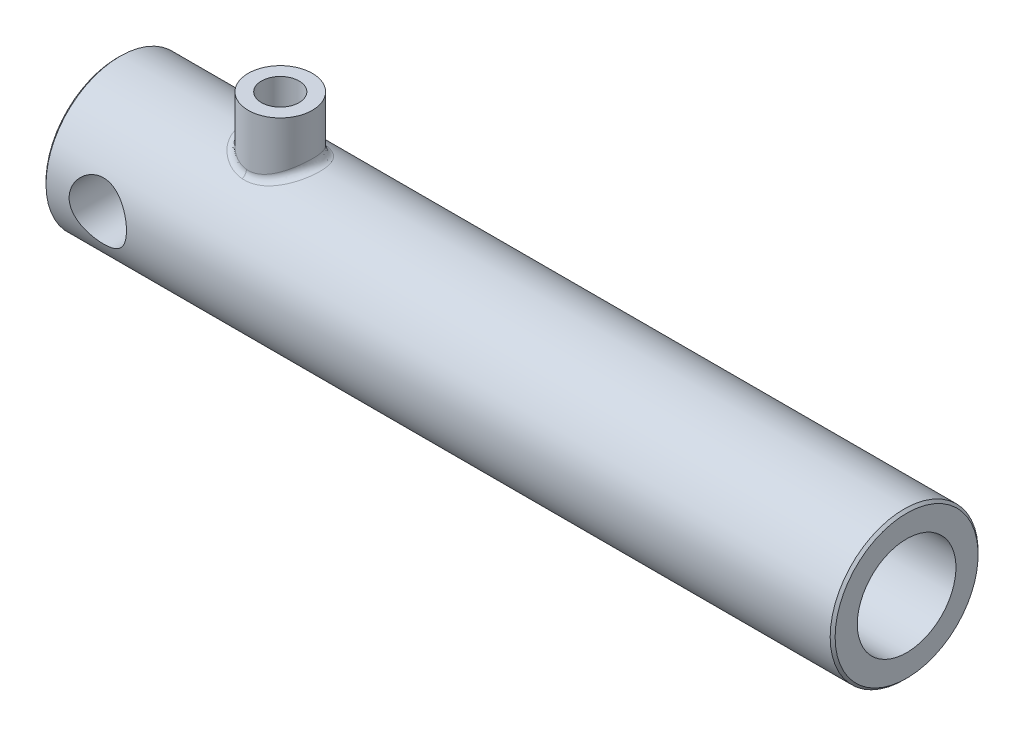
ISO-10303-21;
HEADER;
FILE_DESCRIPTION(('STEP AP214'),'2;1');
FILE_NAME('part.step','',(''),(''),'','','');
FILE_SCHEMA(('AUTOMOTIVE_DESIGN { 1 0 10303 214 1 1 1 1 }'));
ENDSEC;
DATA;
#1=APPLICATION_CONTEXT('core data for automotive mechanical design processes');
#2=APPLICATION_PROTOCOL_DEFINITION('international standard','automotive_design',2000,#1);
#3=PRODUCT_CONTEXT('',#1,'mechanical');
#4=PRODUCT('Part','Part','',(#3));
#5=PRODUCT_RELATED_PRODUCT_CATEGORY('part','',(#4));
#6=PRODUCT_DEFINITION_FORMATION('','',#4);
#7=PRODUCT_DEFINITION_CONTEXT('part definition',#1,'design');
#8=PRODUCT_DEFINITION('design','',#6,#7);
#9=PRODUCT_DEFINITION_SHAPE('','',#8);
#10=(LENGTH_UNIT() NAMED_UNIT(*) SI_UNIT(.MILLI.,.METRE.));
#11=(NAMED_UNIT(*) PLANE_ANGLE_UNIT() SI_UNIT($,.RADIAN.));
#12=(NAMED_UNIT(*) SI_UNIT($,.STERADIAN.) SOLID_ANGLE_UNIT());
#13=UNCERTAINTY_MEASURE_WITH_UNIT(LENGTH_MEASURE(1.E-05),#10,'distance_accuracy_value','');
#14=(GEOMETRIC_REPRESENTATION_CONTEXT(3) GLOBAL_UNCERTAINTY_ASSIGNED_CONTEXT((#13)) GLOBAL_UNIT_ASSIGNED_CONTEXT((#10,
#11,#12)) REPRESENTATION_CONTEXT('',''));
#15=CARTESIAN_POINT('',(0.,0.,0.));
#16=DIRECTION('',(0.,0.,1.));
#17=DIRECTION('',(1.,0.,0.));
#18=AXIS2_PLACEMENT_3D('',#15,#16,#17);
#19=CARTESIAN_POINT('',(48.,25.,0.));
#20=DIRECTION('',(-1.,0.,0.));
#21=DIRECTION('',(0.,0.,1.));
#22=AXIS2_PLACEMENT_3D('',#19,#20,#21);
#23=PLANE('',#22);
#24=CARTESIAN_POINT('',(48.,0.,0.));
#25=DIRECTION('',(-1.,0.,0.));
#26=DIRECTION('',(0.,0.,1.));
#27=AXIS2_PLACEMENT_3D('',#24,#25,#26);
#28=CIRCLE('',#27,25.);
#29=CARTESIAN_POINT('',(48.,0.,25.));
#30=VERTEX_POINT('',#29);
#31=EDGE_CURVE('E262',#30,#30,#28,.F.);
#32=ORIENTED_EDGE('',*,*,#31,.T.);
#33=EDGE_LOOP('',(#32));
#34=FACE_BOUND('',#33,.T.);
#35=ADVANCED_FACE('F16',(#34),#23,.F.);
#36=CARTESIAN_POINT('',(0.,0.,0.));
#37=DIRECTION('',(-1.,0.,0.));
#38=DIRECTION('',(0.,0.,1.));
#39=AXIS2_PLACEMENT_3D('',#36,#37,#38);
#40=CYLINDRICAL_SURFACE('',#39,25.);
#41=CARTESIAN_POINT('',(261.,0.,0.));
#42=DIRECTION('',(-1.,0.,0.));
#43=DIRECTION('',(0.,0.,1.));
#44=AXIS2_PLACEMENT_3D('',#41,#42,#43);
#45=CIRCLE('',#44,25.);
#46=CARTESIAN_POINT('',(261.,0.,25.));
#47=VERTEX_POINT('',#46);
#48=EDGE_CURVE('E254',#47,#47,#45,.F.);
#49=ORIENTED_EDGE('',*,*,#48,.T.);
#50=EDGE_LOOP('',(#49));
#51=FACE_BOUND('',#50,.T.);
#52=CARTESIAN_POINT('',(65.9999999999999,23.808808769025,-7.62499999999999));
#53=CARTESIAN_POINT('',(65.7914527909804,23.8088091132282,-7.62499958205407));
#54=CARTESIAN_POINT('',(65.5828968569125,23.8115563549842,-7.61643683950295));
#55=CARTESIAN_POINT('',(65.1672525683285,23.8224611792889,-7.58225960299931));
#56=CARTESIAN_POINT('',(64.9601648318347,23.8306209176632,-7.55663831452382));
#57=CARTESIAN_POINT('',(64.548766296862,23.8521110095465,-7.48852954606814));
#58=CARTESIAN_POINT('',(64.3444596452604,23.8654483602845,-7.44601923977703));
#59=CARTESIAN_POINT('',(63.9402861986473,23.8968863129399,-7.34449753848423));
#60=CARTESIAN_POINT('',(63.7404211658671,23.914988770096,-7.28547971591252));
#61=CARTESIAN_POINT('',(63.3470957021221,23.9553568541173,-7.15162559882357));
#62=CARTESIAN_POINT('',(63.1536194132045,23.9776110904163,-7.07683251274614));
#63=CARTESIAN_POINT('',(62.7737333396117,24.0256653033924,-6.91192924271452));
#64=CARTESIAN_POINT('',(62.5873262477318,24.0514666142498,-6.82181329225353));
#65=CARTESIAN_POINT('',(62.0407299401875,24.1330851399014,-6.52956478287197));
#66=CARTESIAN_POINT('',(61.6926926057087,24.1931682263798,-6.30536957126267));
#67=CARTESIAN_POINT('',(61.0282024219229,24.3201204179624,-5.79673198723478));
#68=CARTESIAN_POINT('',(60.712998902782,24.3871383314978,-5.51069420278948));
#69=CARTESIAN_POINT('',(60.2790784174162,24.4860866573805,-5.04547650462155));
#70=CARTESIAN_POINT('',(60.1408459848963,24.5188260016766,-4.88426674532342));
#71=CARTESIAN_POINT('',(59.8781993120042,24.5829130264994,-4.55073322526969));
#72=CARTESIAN_POINT('',(59.7537799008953,24.6142612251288,-4.37841366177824));
#73=CARTESIAN_POINT('',(59.5170459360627,24.6753864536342,-4.01983897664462));
#74=CARTESIAN_POINT('',(59.405055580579,24.70511413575,-3.83336152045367));
#75=CARTESIAN_POINT('',(59.1972771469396,24.7613895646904,-3.4512120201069));
#76=CARTESIAN_POINT('',(59.1014831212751,24.7879384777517,-3.25554338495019));
#77=CARTESIAN_POINT('',(58.9268367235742,24.8371090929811,-2.85630197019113));
#78=CARTESIAN_POINT('',(58.8479846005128,24.859730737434,-2.65272907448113));
#79=CARTESIAN_POINT('',(58.7079183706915,24.9003882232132,-2.23915819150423));
#80=CARTESIAN_POINT('',(58.6467036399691,24.9184242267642,-2.02916043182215));
#81=CARTESIAN_POINT('',(58.5440174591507,24.9489221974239,-1.610592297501));
#82=CARTESIAN_POINT('',(58.502016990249,24.9615328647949,-1.4021624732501));
#83=CARTESIAN_POINT('',(58.4355487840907,24.9815790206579,-0.982281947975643));
#84=CARTESIAN_POINT('',(58.4110804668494,24.9890146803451,-0.770831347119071));
#85=CARTESIAN_POINT('',(58.3799098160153,24.9984985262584,-0.346542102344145));
#86=CARTESIAN_POINT('',(58.3732043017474,25.0005476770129,-0.13370371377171));
#87=CARTESIAN_POINT('',(58.3776148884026,24.9992024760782,0.291768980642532));
#88=CARTESIAN_POINT('',(58.3887306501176,24.9958082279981,0.504403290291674));
#89=CARTESIAN_POINT('',(58.4280127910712,24.9838754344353,0.920822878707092));
#90=CARTESIAN_POINT('',(58.4556020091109,24.9755110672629,1.12466791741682));
#91=CARTESIAN_POINT('',(58.5271072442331,24.9540044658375,1.5292873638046));
#92=CARTESIAN_POINT('',(58.5710287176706,24.9408606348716,1.73006072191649));
#93=CARTESIAN_POINT('',(58.6748065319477,24.9101461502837,2.12702658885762));
#94=CARTESIAN_POINT('',(58.734657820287,24.8925769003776,2.32322052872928));
#95=CARTESIAN_POINT('',(58.8698396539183,24.8534580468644,2.70987067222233));
#96=CARTESIAN_POINT('',(58.9451760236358,24.8319069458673,2.90032468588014));
#97=CARTESIAN_POINT('',(59.1116902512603,24.7851110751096,3.27636759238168));
#98=CARTESIAN_POINT('',(59.2030408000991,24.7598265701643,3.46187503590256));
#99=CARTESIAN_POINT('',(59.4003309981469,24.7063957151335,3.82460922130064));
#100=CARTESIAN_POINT('',(59.5062756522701,24.6782483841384,4.00183309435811));
#101=CARTESIAN_POINT('',(59.731992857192,24.6198174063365,4.34686197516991));
#102=CARTESIAN_POINT('',(59.8517650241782,24.5895338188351,4.51466724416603));
#103=CARTESIAN_POINT('',(60.1043604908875,24.5275957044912,4.83988177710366));
#104=CARTESIAN_POINT('',(60.2371841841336,24.4959411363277,4.99729072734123));
#105=CARTESIAN_POINT('',(60.5206006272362,24.4307885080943,5.3068426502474));
#106=CARTESIAN_POINT('',(60.6716904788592,24.3972672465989,5.4585259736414));
#107=CARTESIAN_POINT('',(60.9860694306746,24.3305423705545,5.74864003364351));
#108=CARTESIAN_POINT('',(61.1493546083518,24.2973386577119,5.88707499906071));
#109=CARTESIAN_POINT('',(61.4872830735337,24.2321374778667,6.14994897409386));
#110=CARTESIAN_POINT('',(61.6619357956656,24.2001410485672,6.27437611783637));
#111=CARTESIAN_POINT('',(62.0213022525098,24.1383118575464,6.50818898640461));
#112=CARTESIAN_POINT('',(62.2060120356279,24.1084782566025,6.61758056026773));
#113=CARTESIAN_POINT('',(62.5865230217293,24.0515159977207,6.82172578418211));
#114=CARTESIAN_POINT('',(62.7824265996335,24.0244220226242,6.91629850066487));
#115=CARTESIAN_POINT('',(63.1819510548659,23.9741845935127,7.08847793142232));
#116=CARTESIAN_POINT('',(63.3855687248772,23.9510395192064,7.16609160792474));
#117=CARTESIAN_POINT('',(63.7987966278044,23.9094644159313,7.30360649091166));
#118=CARTESIAN_POINT('',(64.0083964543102,23.8910266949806,7.36353661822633));
#119=CARTESIAN_POINT('',(64.4322510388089,23.8594339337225,7.46527013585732));
#120=CARTESIAN_POINT('',(64.6465035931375,23.8462764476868,7.50708191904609));
#121=CARTESIAN_POINT('',(65.050343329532,23.8269996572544,7.56802232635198));
#122=CARTESIAN_POINT('',(65.2395655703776,23.8201936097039,7.58937401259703));
#123=CARTESIAN_POINT('',(65.6191894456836,23.8110979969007,7.61786307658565));
#124=CARTESIAN_POINT('',(65.809591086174,23.8088084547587,7.62500038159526));
#125=CARTESIAN_POINT('',(66.2085472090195,23.8088091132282,7.62499958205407));
#126=CARTESIAN_POINT('',(66.4171031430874,23.8115563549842,7.61643683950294));
#127=CARTESIAN_POINT('',(66.8327474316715,23.8224611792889,7.5822596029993));
#128=CARTESIAN_POINT('',(67.0398351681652,23.8306209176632,7.55663831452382));
#129=CARTESIAN_POINT('',(67.4512337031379,23.8521110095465,7.48852954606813));
#130=CARTESIAN_POINT('',(67.6555403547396,23.8654483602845,7.44601923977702));
#131=CARTESIAN_POINT('',(68.0597138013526,23.8968863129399,7.34449753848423));
#132=CARTESIAN_POINT('',(68.2595788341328,23.914988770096,7.28547971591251));
#133=CARTESIAN_POINT('',(68.6529042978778,23.9553568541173,7.15162559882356));
#134=CARTESIAN_POINT('',(68.8463805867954,23.9776110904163,7.07683251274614));
#135=CARTESIAN_POINT('',(69.2262666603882,24.0256653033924,6.91192924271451));
#136=CARTESIAN_POINT('',(69.4126737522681,24.0514666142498,6.82181329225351));
#137=CARTESIAN_POINT('',(69.9592700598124,24.1330851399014,6.52956478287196));
#138=CARTESIAN_POINT('',(70.3073073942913,24.1931682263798,6.30536957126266));
#139=CARTESIAN_POINT('',(70.971797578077,24.3201204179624,5.79673198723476));
#140=CARTESIAN_POINT('',(71.2870010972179,24.3871383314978,5.51069420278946));
#141=CARTESIAN_POINT('',(71.7209215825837,24.4860866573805,5.04547650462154));
#142=CARTESIAN_POINT('',(71.8591540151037,24.5188260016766,4.88426674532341));
#143=CARTESIAN_POINT('',(72.1218006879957,24.5829130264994,4.55073322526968));
#144=CARTESIAN_POINT('',(72.2462200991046,24.6142612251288,4.37841366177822));
#145=CARTESIAN_POINT('',(72.4829540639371,24.6753864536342,4.0198389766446));
#146=CARTESIAN_POINT('',(72.5949444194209,24.70511413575,3.83336152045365));
#147=CARTESIAN_POINT('',(72.8027228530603,24.7613895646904,3.45121202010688));
#148=CARTESIAN_POINT('',(72.8985168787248,24.7879384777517,3.25554338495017));
#149=CARTESIAN_POINT('',(73.0731632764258,24.8371090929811,2.85630197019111));
#150=CARTESIAN_POINT('',(73.1520153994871,24.859730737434,2.65272907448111));
#151=CARTESIAN_POINT('',(73.2920816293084,24.9003882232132,2.2391581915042));
#152=CARTESIAN_POINT('',(73.3532963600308,24.9184242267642,2.02916043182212));
#153=CARTESIAN_POINT('',(73.4559825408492,24.9489221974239,1.61059229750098));
#154=CARTESIAN_POINT('',(73.4979830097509,24.9615328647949,1.40216247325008));
#155=CARTESIAN_POINT('',(73.5644512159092,24.9815790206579,0.982281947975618));
#156=CARTESIAN_POINT('',(73.5889195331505,24.9890146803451,0.770831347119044));
#157=CARTESIAN_POINT('',(73.6200901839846,24.9984985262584,0.346542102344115));
#158=CARTESIAN_POINT('',(73.6267956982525,25.0005476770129,0.133703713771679));
#159=CARTESIAN_POINT('',(73.6223851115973,24.9992024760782,-0.291768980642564));
#160=CARTESIAN_POINT('',(73.6112693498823,24.9958082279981,-0.504403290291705));
#161=CARTESIAN_POINT('',(73.5719872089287,24.9838754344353,-0.920822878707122));
#162=CARTESIAN_POINT('',(73.544397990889,24.9755110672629,-1.12466791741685));
#163=CARTESIAN_POINT('',(73.4728927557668,24.9540044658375,-1.52928736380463));
#164=CARTESIAN_POINT('',(73.4289712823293,24.9408606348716,-1.73006072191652));
#165=CARTESIAN_POINT('',(73.3251934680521,24.9101461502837,-2.12702658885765));
#166=CARTESIAN_POINT('',(73.2653421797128,24.8925769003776,-2.3232205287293));
#167=CARTESIAN_POINT('',(73.1301603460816,24.8534580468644,-2.70987067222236));
#168=CARTESIAN_POINT('',(73.054823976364,24.8319069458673,-2.90032468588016));
#169=CARTESIAN_POINT('',(72.8883097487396,24.7851110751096,-3.2763675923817));
#170=CARTESIAN_POINT('',(72.7969591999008,24.7598265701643,-3.46187503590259));
#171=CARTESIAN_POINT('',(72.599669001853,24.7063957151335,-3.82460922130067));
#172=CARTESIAN_POINT('',(72.4937243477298,24.6782483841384,-4.00183309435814));
#173=CARTESIAN_POINT('',(72.2680071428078,24.6198174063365,-4.34686197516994));
#174=CARTESIAN_POINT('',(72.1482349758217,24.5895338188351,-4.51466724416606));
#175=CARTESIAN_POINT('',(71.8956395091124,24.5275957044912,-4.83988177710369));
#176=CARTESIAN_POINT('',(71.7628158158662,24.4959411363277,-4.99729072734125));
#177=CARTESIAN_POINT('',(71.4793993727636,24.4307885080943,-5.30684265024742));
#178=CARTESIAN_POINT('',(71.3283095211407,24.3972672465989,-5.45852597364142));
#179=CARTESIAN_POINT('',(71.0139305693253,24.3305423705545,-5.74864003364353));
#180=CARTESIAN_POINT('',(70.8506453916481,24.2973386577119,-5.88707499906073));
#181=CARTESIAN_POINT('',(70.5127169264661,24.2321374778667,-6.14994897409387));
#182=CARTESIAN_POINT('',(70.3380642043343,24.2001410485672,-6.27437611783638));
#183=CARTESIAN_POINT('',(69.9786977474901,24.1383118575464,-6.50818898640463));
#184=CARTESIAN_POINT('',(69.793987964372,24.1084782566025,-6.61758056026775));
#185=CARTESIAN_POINT('',(69.4134769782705,24.0515159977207,-6.82172578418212));
#186=CARTESIAN_POINT('',(69.2175734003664,24.0244220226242,-6.91629850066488));
#187=CARTESIAN_POINT('',(68.818048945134,23.9741845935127,-7.08847793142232));
#188=CARTESIAN_POINT('',(68.6144312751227,23.9510395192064,-7.16609160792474));
#189=CARTESIAN_POINT('',(68.2012033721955,23.9094644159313,-7.30360649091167));
#190=CARTESIAN_POINT('',(67.9916035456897,23.8910266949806,-7.36353661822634));
#191=CARTESIAN_POINT('',(67.567748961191,23.8594339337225,-7.46527013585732));
#192=CARTESIAN_POINT('',(67.3534964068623,23.8462764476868,-7.50708191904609));
#193=CARTESIAN_POINT('',(66.9496566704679,23.8269996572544,-7.56802232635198));
#194=CARTESIAN_POINT('',(66.7604344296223,23.8201936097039,-7.58937401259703));
#195=CARTESIAN_POINT('',(66.3808105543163,23.8110979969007,-7.61786307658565));
#196=CARTESIAN_POINT('',(66.1904089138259,23.8088084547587,-7.62500038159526));
#197=CARTESIAN_POINT('',(65.9999999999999,23.808808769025,-7.62499999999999));
#198=B_SPLINE_CURVE_WITH_KNOTS('',3,(#52,#53,#54,#55,#56,#57,#58,#59,#60,#61,#62,#63,#64,#65,
#66,#67,#68,#69,#70,#71,#72,#73,#74,#75,#76,#77,#78,#79,#80,#81,#82,#83,#84,#85,#86,#87,#88,#89,
#90,#91,#92,#93,#94,#95,#96,#97,#98,#99,#100,#101,#102,#103,#104,#105,#106,#107,#108,#109,#110,
#111,#112,#113,#114,#115,#116,#117,#118,#119,#120,#121,#122,#123,#124,#125,#126,#127,#128,#129,
#130,#131,#132,#133,#134,#135,#136,#137,#138,#139,#140,#141,#142,#143,#144,#145,#146,#147,#148,
#149,#150,#151,#152,#153,#154,#155,#156,#157,#158,#159,#160,#161,#162,#163,#164,#165,#166,#167,
#168,#169,#170,#171,#172,#173,#174,#175,#176,#177,#178,#179,#180,#181,#182,#183,#184,#185,#186,
#187,#188,#189,#190,#191,#192,#193,#194,#195,#196,#197),.UNSPECIFIED.,.T.,.F.,(4,2,2,2,2,2,2,2,
2,2,2,2,2,2,2,2,2,2,2,2,2,2,2,2,2,2,2,2,2,2,2,2,2,2,2,2,2,2,2,2,2,2,2,2,2,2,2,2,2,2,2,2,2,2,2,2,
2,2,2,2,2,2,2,2,2,2,2,2,2,2,2,2,4),(0.,0.625463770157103,1.25117681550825,1.87773843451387,
2.50454435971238,3.12965525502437,3.75500192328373,5.00420552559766,6.29061250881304,
6.93460907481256,7.5783637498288,8.23619571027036,8.89378557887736,9.55138511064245,
10.2089613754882,10.8471446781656,11.4853068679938,12.1233547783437,12.7613905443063,
13.378285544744,13.9953868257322,14.612292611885,15.2294308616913,15.8536870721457,
16.47815790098,17.1026114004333,17.7270837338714,18.3764353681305,19.0255790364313,
19.6752685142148,20.3247045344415,20.9815382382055,21.6381017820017,22.2935855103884,
22.9487652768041,23.5198267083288,24.0908910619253,24.7163548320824,25.3420678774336,
25.9686294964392,26.5954354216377,27.2205463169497,27.845892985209,29.095096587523,
30.3815035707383,31.0255001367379,31.6692548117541,32.3270867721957,32.9846766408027,
33.6422761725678,34.2998524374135,34.9380357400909,35.5761979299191,36.214245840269,
36.8522816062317,37.4691766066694,38.0862778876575,38.7031836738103,39.3203219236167,
39.944578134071,40.5690489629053,41.1935024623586,41.8179747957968,42.4673264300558,
43.1164700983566,43.7661595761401,44.4155955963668,45.0724293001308,45.728992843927,
46.3844765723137,47.0396563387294,47.610717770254,48.1817821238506),.UNSPECIFIED.);
#199=CARTESIAN_POINT('',(65.9999999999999,23.808808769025,-7.62499999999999));
#200=VERTEX_POINT('',#199);
#201=EDGE_CURVE('E257',#200,#200,#198,.T.);
#202=ORIENTED_EDGE('',*,*,#201,.T.);
#203=EDGE_LOOP('',(#202));
#204=FACE_BOUND('',#203,.T.);
#205=ORIENTED_EDGE('',*,*,#31,.F.);
#206=EDGE_LOOP('',(#205));
#207=FACE_BOUND('',#206,.T.);
#208=ADVANCED_FACE('F263',(#51,#204,#207),#40,.F.);
#209=CARTESIAN_POINT('',(65.9999999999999,50.,0.));
#210=DIRECTION('',(0.,1.,0.));
#211=DIRECTION('',(0.,0.,1.));
#212=AXIS2_PLACEMENT_3D('',#209,#210,#211);
#213=CYLINDRICAL_SURFACE('',#212,7.62499999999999);
#214=CARTESIAN_POINT('',(65.9999999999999,50.,0.));
#215=DIRECTION('',(0.,1.,0.));
#216=DIRECTION('',(0.,0.,1.));
#217=AXIS2_PLACEMENT_3D('',#214,#215,#216);
#218=CIRCLE('',#217,7.62499999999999);
#219=CARTESIAN_POINT('',(65.9999999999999,50.,7.62499999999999));
#220=VERTEX_POINT('',#219);
#221=EDGE_CURVE('E251',#220,#220,#218,.F.);
#222=ORIENTED_EDGE('',*,*,#221,.F.);
#223=EDGE_LOOP('',(#222));
#224=FACE_BOUND('',#223,.T.);
#225=ORIENTED_EDGE('',*,*,#201,.F.);
#226=EDGE_LOOP('',(#225));
#227=FACE_BOUND('',#226,.T.);
#228=ADVANCED_FACE('F265',(#224,#227),#213,.F.);
#229=CARTESIAN_POINT('',(261.,19.9999999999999,0.));
#230=DIRECTION('',(1.,0.,0.));
#231=DIRECTION('',(0.,0.,-1.));
#232=AXIS2_PLACEMENT_3D('',#229,#230,#231);
#233=PLANE('',#232);
#234=ORIENTED_EDGE('',*,*,#48,.F.);
#235=EDGE_LOOP('',(#234));
#236=FACE_BOUND('',#235,.T.);
#237=CARTESIAN_POINT('',(261.,0.,0.));
#238=DIRECTION('',(-1.,0.,0.));
#239=DIRECTION('',(0.,0.,1.));
#240=AXIS2_PLACEMENT_3D('',#237,#238,#239);
#241=CIRCLE('',#240,20.);
#242=CARTESIAN_POINT('',(261.,0.,20.));
#243=VERTEX_POINT('',#242);
#244=EDGE_CURVE('E62',#243,#243,#241,.F.);
#245=ORIENTED_EDGE('',*,*,#244,.T.);
#246=EDGE_LOOP('',(#245));
#247=FACE_BOUND('',#246,.T.);
#248=ADVANCED_FACE('F269',(#236,#247),#233,.F.);
#249=CARTESIAN_POINT('',(65.9999999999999,50.,0.));
#250=DIRECTION('',(0.,1.,0.));
#251=DIRECTION('',(0.,0.,1.));
#252=AXIS2_PLACEMENT_3D('',#249,#250,#251);
#253=PLANE('',#252);
#254=CARTESIAN_POINT('',(65.9999999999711,50.0000000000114,0.));
#255=DIRECTION('',(0.,1.,0.));
#256=DIRECTION('',(0.,0.,1.));
#257=AXIS2_PLACEMENT_3D('',#254,#255,#256);
#258=CIRCLE('',#257,13.);
#259=CARTESIAN_POINT('',(65.9999999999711,50.0000000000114,13.));
#260=VERTEX_POINT('',#259);
#261=EDGE_CURVE('E61',#260,#260,#258,.F.);
#262=ORIENTED_EDGE('',*,*,#261,.F.);
#263=EDGE_LOOP('',(#262));
#264=FACE_BOUND('',#263,.T.);
#265=ORIENTED_EDGE('',*,*,#221,.T.);
#266=EDGE_LOOP('',(#265));
#267=FACE_BOUND('',#266,.T.);
#268=ADVANCED_FACE('F272',(#264,#267),#253,.T.);
#269=CARTESIAN_POINT('',(0.,0.,0.));
#270=DIRECTION('',(-1.,0.,0.));
#271=DIRECTION('',(0.,0.,1.));
#272=AXIS2_PLACEMENT_3D('',#269,#270,#271);
#273=CYLINDRICAL_SURFACE('',#272,20.);
#274=CARTESIAN_POINT('',(320.,0.,0.));
#275=DIRECTION('',(-1.,0.,0.));
#276=DIRECTION('',(0.,0.,1.));
#277=AXIS2_PLACEMENT_3D('',#274,#275,#276);
#278=CIRCLE('',#277,20.);
#279=CARTESIAN_POINT('',(320.,0.,20.));
#280=VERTEX_POINT('',#279);
#281=EDGE_CURVE('E72',#280,#280,#278,.F.);
#282=ORIENTED_EDGE('',*,*,#281,.T.);
#283=EDGE_LOOP('',(#282));
#284=FACE_BOUND('',#283,.T.);
#285=ORIENTED_EDGE('',*,*,#244,.F.);
#286=EDGE_LOOP('',(#285));
#287=FACE_BOUND('',#286,.T.);
#288=ADVANCED_FACE('F135',(#284,#287),#273,.F.);
#289=CARTESIAN_POINT('',(65.9999999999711,-500000.,0.));
#290=DIRECTION('',(0.,1.,0.));
#291=DIRECTION('',(0.,0.,1.));
#292=AXIS2_PLACEMENT_3D('',#289,#290,#291);
#293=CYLINDRICAL_SURFACE('',#292,13.);
#294=ORIENTED_EDGE('',*,*,#261,.T.);
#295=EDGE_LOOP('',(#294));
#296=FACE_BOUND('',#295,.T.);
#297=CARTESIAN_POINT('',(66.0000001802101,28.8617393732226,-12.9996613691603));
#298=CARTESIAN_POINT('',(66.0314306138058,28.861736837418,-12.999678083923));
#299=CARTESIAN_POINT('',(66.0628611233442,28.8618112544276,-12.999581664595));
#300=CARTESIAN_POINT('',(66.1256832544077,28.8621145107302,-12.9991620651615));
#301=CARTESIAN_POINT('',(66.1570748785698,28.8623431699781,-12.998839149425));
#302=CARTESIAN_POINT('',(66.2198142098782,28.8629550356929,-12.9979666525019));
#303=CARTESIAN_POINT('',(66.2511619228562,28.8633380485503,-12.9974173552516));
#304=CARTESIAN_POINT('',(66.3138083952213,28.8642587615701,-12.9960921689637));
#305=CARTESIAN_POINT('',(66.3451071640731,28.8647962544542,-12.995316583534));
#306=CARTESIAN_POINT('',(66.407650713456,28.8660260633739,-12.9935389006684));
#307=CARTESIAN_POINT('',(66.4388955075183,28.8667181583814,-12.9925371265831));
#308=CARTESIAN_POINT('',(66.501326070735,28.8682573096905,-12.9903071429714));
#309=CARTESIAN_POINT('',(66.5325118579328,28.8691041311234,-12.9890792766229));
#310=CARTESIAN_POINT('',(66.5948193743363,28.870952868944,-12.9863971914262));
#311=CARTESIAN_POINT('',(66.6259411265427,28.8719545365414,-12.9849433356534));
#312=CARTESIAN_POINT('',(66.688115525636,28.8741131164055,-12.9818093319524));
#313=CARTESIAN_POINT('',(66.7191682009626,28.8752697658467,-12.980129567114));
#314=CARTESIAN_POINT('',(66.7502111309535,28.8765051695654,-12.978335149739));
#315=B_SPLINE_CURVE_WITH_KNOTS('',3,(#297,#298,#299,#300,#301,#302,#303,#304,#305,#306,#307,
#308,#309,#310,#311,#312,#313,#314),.UNSPECIFIED.,.F.,.F.,(4,2,2,2,2,2,2,2,4),(0.,
0.094291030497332,0.188472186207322,0.282535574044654,0.376473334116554,0.470277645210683,
0.563940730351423,0.657454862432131,0.750812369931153),.UNSPECIFIED.);
#316=CARTESIAN_POINT('',(66.7502111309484,28.8765051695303,-12.9783351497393));
#317=VERTEX_POINT('',#316);
#318=CARTESIAN_POINT('',(66.0000000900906,28.8617393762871,-12.9998306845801));
#319=VERTEX_POINT('',#318);
#320=EDGE_CURVE('E69',#317,#319,#315,.F.);
#321=ORIENTED_EDGE('',*,*,#320,.T.);
#322=CARTESIAN_POINT('',(65.2724088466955,28.8756283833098,12.9796229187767));
#323=CARTESIAN_POINT('',(65.1299616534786,28.8810588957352,12.9716432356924));
#324=CARTESIAN_POINT('',(64.9877065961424,28.8880841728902,12.9613374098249));
#325=CARTESIAN_POINT('',(64.7045681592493,28.9052107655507,12.9361538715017));
#326=CARTESIAN_POINT('',(64.5636815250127,28.9152951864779,12.921301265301));
#327=CARTESIAN_POINT('',(64.2832598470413,28.9384422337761,12.8870838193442));
#328=CARTESIAN_POINT('',(64.1437216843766,28.9514932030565,12.8677366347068));
#329=CARTESIAN_POINT('',(63.8659746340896,28.9804700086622,12.8245976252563));
#330=CARTESIAN_POINT('',(63.7277633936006,28.9963890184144,12.8008163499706));
#331=CARTESIAN_POINT('',(63.452647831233,29.0310006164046,12.7488732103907));
#332=CARTESIAN_POINT('',(63.3157424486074,29.0496907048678,12.7207152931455));
#333=CARTESIAN_POINT('',(63.0432149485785,29.0897432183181,12.6600866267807));
#334=CARTESIAN_POINT('',(62.9075934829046,29.1111069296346,12.6276138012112));
#335=CARTESIAN_POINT('',(62.6376100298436,29.1564067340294,12.5584079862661));
#336=CARTESIAN_POINT('',(62.5032507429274,29.1803473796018,12.5216674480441));
#337=CARTESIAN_POINT('',(62.2357881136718,29.2307038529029,12.4438923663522));
#338=CARTESIAN_POINT('',(62.1026899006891,29.25712706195,12.4028449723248));
#339=CARTESIAN_POINT('',(61.8377350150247,29.312346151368,12.3164634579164));
#340=CARTESIAN_POINT('',(61.7058861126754,29.3411517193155,12.2711117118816));
#341=CARTESIAN_POINT('',(61.4433547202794,29.4010692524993,12.1760579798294));
#342=CARTESIAN_POINT('',(61.3126840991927,29.4321941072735,12.1263313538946));
#343=CARTESIAN_POINT('',(61.0527906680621,29.4965684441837,12.0226210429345));
#344=CARTESIAN_POINT('',(60.923578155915,29.5298276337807,11.9686176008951));
#345=CARTESIAN_POINT('',(60.6673289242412,29.5981475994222,11.8566821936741));
#346=CARTESIAN_POINT('',(60.5402924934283,29.6332086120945,11.7987497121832));
#347=CARTESIAN_POINT('',(60.2889739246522,29.7048578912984,11.6792026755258));
#348=CARTESIAN_POINT('',(60.1646838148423,29.7414404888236,11.6176014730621));
#349=CARTESIAN_POINT('',(59.9187536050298,29.8159585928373,11.4908235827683));
#350=CARTESIAN_POINT('',(59.7971079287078,29.8538906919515,11.4256557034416));
#351=CARTESIAN_POINT('',(59.5564299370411,29.9309817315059,11.291737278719));
#352=CARTESIAN_POINT('',(59.4373943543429,29.9701389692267,11.2229916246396));
#353=CARTESIAN_POINT('',(59.2018917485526,30.0495416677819,11.0819394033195));
#354=CARTESIAN_POINT('',(59.0854237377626,30.0897866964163,11.0096342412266));
#355=CARTESIAN_POINT('',(58.855015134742,30.1712296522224,10.8614778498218));
#356=CARTESIAN_POINT('',(58.741075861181,30.2124280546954,10.7856248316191));
#357=CARTESIAN_POINT('',(58.5156838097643,30.2956420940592,10.6303877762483));
#358=CARTESIAN_POINT('',(58.4042346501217,30.3376587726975,10.5509990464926));
#359=CARTESIAN_POINT('',(58.1837763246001,30.4223742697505,10.3887092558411));
#360=CARTESIAN_POINT('',(58.0747730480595,30.4650743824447,10.3058008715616));
#361=CARTESIAN_POINT('',(57.8592205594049,30.5510417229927,10.136410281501));
#362=CARTESIAN_POINT('',(57.7526798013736,30.5943102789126,10.0499179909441));
#363=CARTESIAN_POINT('',(57.5420519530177,30.6812901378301,9.87331449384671));
#364=CARTESIAN_POINT('',(57.4379759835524,30.7250025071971,9.78319055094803));
#365=CARTESIAN_POINT('',(57.2324261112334,30.8126836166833,9.59941177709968));
#366=CARTESIAN_POINT('',(57.1309618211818,30.8566527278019,9.50574637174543));
#367=CARTESIAN_POINT('',(56.9312669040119,30.9444501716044,9.31541857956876));
#368=CARTESIAN_POINT('',(56.8330299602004,30.9882786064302,9.21876286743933));
#369=CARTESIAN_POINT('',(56.6399204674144,31.075600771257,9.02262306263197));
#370=CARTESIAN_POINT('',(56.545038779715,31.1190951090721,8.92314823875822));
#371=CARTESIAN_POINT('',(56.3586921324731,31.205585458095,8.72146676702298));
#372=CARTESIAN_POINT('',(56.2672174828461,31.2485825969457,8.61926955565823));
#373=CARTESIAN_POINT('',(56.0875945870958,31.333981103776,8.41213070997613));
#374=CARTESIAN_POINT('',(55.9994402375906,31.3763834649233,8.30719477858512));
#375=CARTESIAN_POINT('',(55.826464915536,31.4604851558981,8.09452669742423));
#376=CARTESIAN_POINT('',(55.7416406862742,31.5021851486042,7.98679745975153));
#377=CARTESIAN_POINT('',(55.5753306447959,31.5847699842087,7.76851132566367));
#378=CARTESIAN_POINT('',(55.4938443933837,31.6256549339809,7.65795480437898));
#379=CARTESIAN_POINT('',(55.3342172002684,31.7064981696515,7.43398036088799));
#380=CARTESIAN_POINT('',(55.2560788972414,31.7464557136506,7.32056028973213));
#381=CARTESIAN_POINT('',(55.103157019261,31.8253323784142,7.09082373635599));
#382=CARTESIAN_POINT('',(55.0283794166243,31.8642496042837,6.97450262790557));
#383=CARTESIAN_POINT('',(54.8821847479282,31.9409308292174,6.73895219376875));
#384=CARTESIAN_POINT('',(54.8107767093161,31.9786916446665,6.61971622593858));
#385=CARTESIAN_POINT('',(54.6715838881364,32.0528411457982,6.37854771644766));
#386=CARTESIAN_POINT('',(54.6038030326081,32.0892283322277,6.25661244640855));
#387=CARTESIAN_POINT('',(54.4721353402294,32.1603931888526,6.01054716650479));
#388=CARTESIAN_POINT('',(54.4082406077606,32.1951740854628,5.88642231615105));
#389=CARTESIAN_POINT('',(54.2846289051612,32.2628819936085,5.6364223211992));
#390=CARTESIAN_POINT('',(54.2248927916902,32.2958173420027,5.51055890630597));
#391=CARTESIAN_POINT('',(54.1095604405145,32.3597642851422,5.25708287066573));
#392=CARTESIAN_POINT('',(54.053949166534,32.3907827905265,5.12947883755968));
#393=CARTESIAN_POINT('',(53.9468348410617,32.4508393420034,4.87245538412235));
#394=CARTESIAN_POINT('',(53.8953227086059,32.479881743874,4.74304076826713));
#395=CARTESIAN_POINT('',(53.7964071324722,32.5359085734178,4.48238605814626));
#396=CARTESIAN_POINT('',(53.7489990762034,32.5628953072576,4.35114821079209));
#397=CARTESIAN_POINT('',(53.6583051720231,32.6147344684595,4.0868309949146));
#398=CARTESIAN_POINT('',(53.6150195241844,32.6395867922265,3.95375153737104));
#399=CARTESIAN_POINT('',(53.5326242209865,32.6870719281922,3.68571959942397));
#400=CARTESIAN_POINT('',(53.4935200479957,32.7097018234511,3.55076491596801));
#401=CARTESIAN_POINT('',(53.4195213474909,32.7526648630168,3.27895821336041));
#402=CARTESIAN_POINT('',(53.3846380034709,32.7729918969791,3.14210218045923));
#403=CARTESIAN_POINT('',(53.3192356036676,32.8112074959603,2.86666867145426));
#404=CARTESIAN_POINT('',(53.2887269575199,32.8290902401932,2.72808791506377));
#405=CARTESIAN_POINT('',(53.2322049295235,32.8623018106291,2.4498889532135));
#406=CARTESIAN_POINT('',(53.2061860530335,32.8776337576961,2.31027223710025));
#407=CARTESIAN_POINT('',(53.1588298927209,32.9055967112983,2.03071588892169));
#408=CARTESIAN_POINT('',(53.1374694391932,32.9182410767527,1.89078152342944));
#409=CARTESIAN_POINT('',(53.0993851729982,32.9408052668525,1.61074249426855));
#410=CARTESIAN_POINT('',(53.0826399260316,32.9507376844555,1.47064176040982));
#411=CARTESIAN_POINT('',(53.0537380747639,32.9678966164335,1.19016319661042));
#412=CARTESIAN_POINT('',(53.0415699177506,32.9751299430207,1.049786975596));
#413=CARTESIAN_POINT('',(53.0218312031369,32.9868768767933,0.768757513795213));
#414=CARTESIAN_POINT('',(53.0142554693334,32.9913935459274,0.628104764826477));
#415=CARTESIAN_POINT('',(53.0036997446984,32.9976988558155,0.346521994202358));
#416=CARTESIAN_POINT('',(53.0007211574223,32.9994866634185,0.205591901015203));
#417=CARTESIAN_POINT('',(52.9993656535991,33.0003238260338,-0.0765422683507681));
#418=CARTESIAN_POINT('',(53.0009967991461,32.9993683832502,-0.217746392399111));
#419=CARTESIAN_POINT('',(53.0100304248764,32.9940092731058,-0.543125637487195));
#420=CARTESIAN_POINT('',(53.0190445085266,32.9886409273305,-0.727243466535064));
#421=CARTESIAN_POINT('',(53.0447237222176,32.9733550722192,-1.09216557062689));
#422=CARTESIAN_POINT('',(53.061280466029,32.9635020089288,-1.2729802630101));
#423=CARTESIAN_POINT('',(53.1014027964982,32.9396823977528,-1.62972901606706));
#424=CARTESIAN_POINT('',(53.1248152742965,32.9258057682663,-1.80568631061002));
#425=CARTESIAN_POINT('',(53.178093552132,32.8943055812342,-2.1515014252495));
#426=CARTESIAN_POINT('',(53.2077731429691,32.8767903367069,-2.32139783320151));
#427=CARTESIAN_POINT('',(53.2729451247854,32.8384583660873,-2.65527403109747));
#428=CARTESIAN_POINT('',(53.3082753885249,32.8177341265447,-2.81929615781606));
#429=CARTESIAN_POINT('',(53.3842492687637,32.7733402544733,-3.14160508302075));
#430=CARTESIAN_POINT('',(53.4247501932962,32.7497503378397,-3.29993654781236));
#431=CARTESIAN_POINT('',(53.5105458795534,32.6999705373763,-3.6110467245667));
#432=CARTESIAN_POINT('',(53.5557155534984,32.6738492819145,-3.76387096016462));
#433=CARTESIAN_POINT('',(53.650484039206,32.619313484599,-4.06410316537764));
#434=CARTESIAN_POINT('',(53.6999702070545,32.5909584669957,-4.21155752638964));
#435=CARTESIAN_POINT('',(53.8029999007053,32.5322464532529,-4.5011859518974));
#436=CARTESIAN_POINT('',(53.8564420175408,32.5019410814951,-4.64340659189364));
#437=CARTESIAN_POINT('',(53.9670245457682,32.439600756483,-4.92269930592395));
#438=CARTESIAN_POINT('',(54.0240732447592,32.4076106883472,-5.05981774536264));
#439=CARTESIAN_POINT('',(54.141515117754,32.3421571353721,-5.32903543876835));
#440=CARTESIAN_POINT('',(54.2018249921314,32.3087327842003,-5.4611805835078));
#441=CARTESIAN_POINT('',(54.3252827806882,32.2407412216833,-5.72022073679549));
#442=CARTESIAN_POINT('',(54.3883434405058,32.2062132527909,-5.84716765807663));
#443=CARTESIAN_POINT('',(54.5165800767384,32.1364905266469,-6.09507553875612));
#444=CARTESIAN_POINT('',(54.5816486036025,32.1013409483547,-6.21610481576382));
#445=CARTESIAN_POINT('',(54.7134581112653,32.0306578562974,-6.45225567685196));
#446=CARTESIAN_POINT('',(54.7800962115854,31.9951648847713,-6.56744686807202));
#447=CARTESIAN_POINT('',(54.9146778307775,31.9240283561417,-6.79207524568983));
#448=CARTESIAN_POINT('',(54.9825243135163,31.8884203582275,-6.90158182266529));
#449=CARTESIAN_POINT('',(55.1192593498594,31.8172241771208,-7.11514336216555));
#450=CARTESIAN_POINT('',(55.188060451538,31.7816654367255,-7.21926429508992));
#451=CARTESIAN_POINT('',(55.3926441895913,31.6767993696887,-7.51938912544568));
#452=CARTESIAN_POINT('',(55.532200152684,31.606336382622,-7.71243935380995));
#453=CARTESIAN_POINT('',(55.8128051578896,31.467178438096,-8.07905993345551));
#454=CARTESIAN_POINT('',(55.9532962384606,31.3986186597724,-8.25311038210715));
#455=CARTESIAN_POINT('',(56.2340844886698,31.264174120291,-8.58319927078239));
#456=CARTESIAN_POINT('',(56.3738887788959,31.1983752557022,-8.73969206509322));
#457=CARTESIAN_POINT('',(56.651780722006,31.0701515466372,-9.03597718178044));
#458=CARTESIAN_POINT('',(56.7894289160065,31.0077730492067,-9.17620186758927));
#459=CARTESIAN_POINT('',(57.0284258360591,30.9016483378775,-9.40896758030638));
#460=CARTESIAN_POINT('',(57.128211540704,30.857952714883,-9.50314261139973));
#461=CARTESIAN_POINT('',(57.3304301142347,30.7707512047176,-9.68800239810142));
#462=CARTESIAN_POINT('',(57.4328539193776,30.7272451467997,-9.77869697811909));
#463=CARTESIAN_POINT('',(57.6402176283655,30.6405826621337,-9.95659753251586));
#464=CARTESIAN_POINT('',(57.7451486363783,30.5974255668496,-10.0438135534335));
#465=CARTESIAN_POINT('',(57.9575630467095,30.5115867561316,-10.214763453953));
#466=CARTESIAN_POINT('',(58.0650400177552,30.468904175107,-10.2985048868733));
#467=CARTESIAN_POINT('',(58.2825625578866,30.3841407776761,-10.4625237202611));
#468=CARTESIAN_POINT('',(58.3926040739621,30.3420591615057,-10.5428060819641));
#469=CARTESIAN_POINT('',(58.6152758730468,30.2586238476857,-10.6999216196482));
#470=CARTESIAN_POINT('',(58.7279044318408,30.217269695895,-10.7767569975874));
#471=CARTESIAN_POINT('',(58.9557708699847,30.1354158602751,-10.9269921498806));
#472=CARTESIAN_POINT('',(59.071009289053,30.0949163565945,-11.0003912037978));
#473=CARTESIAN_POINT('',(59.304140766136,30.0148850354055,-11.143795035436));
#474=CARTESIAN_POINT('',(59.4220371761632,29.9753545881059,-11.2137951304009));
#475=CARTESIAN_POINT('',(59.6606173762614,29.897389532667,-11.3503718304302));
#476=CARTESIAN_POINT('',(59.7813079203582,29.8589582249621,-11.4169385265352));
#477=CARTESIAN_POINT('',(60.0252749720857,29.7834093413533,-11.5464854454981));
#478=CARTESIAN_POINT('',(60.1485553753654,29.7462940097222,-11.6094596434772));
#479=CARTESIAN_POINT('',(60.397406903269,29.6736333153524,-11.7315862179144));
#480=CARTESIAN_POINT('',(60.5229774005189,29.6380875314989,-11.7907396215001));
#481=CARTESIAN_POINT('',(60.7757363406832,29.5688964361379,-11.9048877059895));
#482=CARTESIAN_POINT('',(60.9029140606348,29.5352427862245,-11.9599010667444));
#483=CARTESIAN_POINT('',(61.1596879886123,29.4697431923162,-12.066110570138));
#484=CARTESIAN_POINT('',(61.2892892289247,29.4379017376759,-12.1172973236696));
#485=CARTESIAN_POINT('',(61.5500248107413,29.3763955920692,-12.2154437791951));
#486=CARTESIAN_POINT('',(61.6811518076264,29.3467233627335,-12.2624182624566));
#487=CARTESIAN_POINT('',(61.9449374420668,29.2896605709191,-12.3521846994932));
#488=CARTESIAN_POINT('',(62.0775913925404,29.2622644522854,-12.3949868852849));
#489=CARTESIAN_POINT('',(62.3444601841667,29.2098670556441,-12.4763597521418));
#490=CARTESIAN_POINT('',(62.4786727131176,29.1848626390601,-12.5149359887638));
#491=CARTESIAN_POINT('',(62.7486843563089,29.1373602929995,-12.5878179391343));
#492=CARTESIAN_POINT('',(62.8844833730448,29.1148622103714,-12.6221239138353));
#493=CARTESIAN_POINT('',(63.1576908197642,29.0724862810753,-12.6864242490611));
#494=CARTESIAN_POINT('',(63.2951010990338,29.0526118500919,-12.7164129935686));
#495=CARTESIAN_POINT('',(63.6117498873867,29.0102057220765,-12.780123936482));
#496=CARTESIAN_POINT('',(63.7914174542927,28.9886086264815,-12.8123547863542));
#497=CARTESIAN_POINT('',(64.1132765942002,28.9544516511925,-12.8631496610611));
#498=CARTESIAN_POINT('',(64.2551416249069,28.9409476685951,-12.8831616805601));
#499=CARTESIAN_POINT('',(64.4996311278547,28.9204478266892,-12.9134394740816));
#500=CARTESIAN_POINT('',(64.6020498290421,28.9126902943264,-12.9248626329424));
#501=CARTESIAN_POINT('',(64.8586599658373,28.895307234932,-12.9504046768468));
#502=CARTESIAN_POINT('',(65.0130732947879,28.8866940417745,-12.9630053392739));
#503=CARTESIAN_POINT('',(65.4445826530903,28.8678484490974,-12.9905452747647));
#504=CARTESIAN_POINT('',(65.7222586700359,28.8617094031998,-12.9994723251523));
#505=CARTESIAN_POINT('',(66.0000001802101,28.8617393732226,-12.9996613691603));
#506=B_SPLINE_CURVE_WITH_KNOTS('',3,(#322,#323,#324,#325,#326,#327,#328,#329,#330,#331,#332,
#333,#334,#335,#336,#337,#338,#339,#340,#341,#342,#343,#344,#345,#346,#347,#348,#349,#350,#351,
#352,#353,#354,#355,#356,#357,#358,#359,#360,#361,#362,#363,#364,#365,#366,#367,#368,#369,#370,
#371,#372,#373,#374,#375,#376,#377,#378,#379,#380,#381,#382,#383,#384,#385,#386,#387,#388,#389,
#390,#391,#392,#393,#394,#395,#396,#397,#398,#399,#400,#401,#402,#403,#404,#405,#406,#407,#408,
#409,#410,#411,#412,#413,#414,#415,#416,#417,#418,#419,#420,#421,#422,#423,#424,#425,#426,#427,
#428,#429,#430,#431,#432,#433,#434,#435,#436,#437,#438,#439,#440,#441,#442,#443,#444,#445,#446,
#447,#448,#449,#450,#451,#452,#453,#454,#455,#456,#457,#458,#459,#460,#461,#462,#463,#464,#465,
#466,#467,#468,#469,#470,#471,#472,#473,#474,#475,#476,#477,#478,#479,#480,#481,#482,#483,#484,
#485,#486,#487,#488,#489,#490,#491,#492,#493,#494,#495,#496,#497,#498,#499,#500,#501,#502,#503,
#504,#505),.UNSPECIFIED.,.F.,.F.,(4,2,2,2,2,2,2,2,2,2,2,2,2,2,2,2,2,2,2,2,2,2,2,2,2,2,2,2,2,2,2,
2,2,2,2,2,2,2,2,2,2,2,2,2,2,2,2,2,2,2,2,2,2,2,2,2,2,2,2,2,2,2,2,2,2,2,2,2,2,2,2,2,2,2,2,2,2,2,2,
2,2,2,2,2,2,2,2,2,2,2,2,4),(0.,0.428292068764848,0.85426061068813,1.27858338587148,
1.70190921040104,2.1248554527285,2.54800597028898,2.97191670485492,3.39713032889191,
3.82416715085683,4.25378540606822,4.68551920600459,5.11730984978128,5.54761504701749,
5.97690168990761,6.40561611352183,6.8341626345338,7.26292761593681,7.69227967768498,
8.12257366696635,8.5541738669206,8.98744824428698,9.42213826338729,9.85591954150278,
10.2884104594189,10.7195591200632,11.1498721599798,11.5797533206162,12.0095777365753,
12.4397349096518,12.8706285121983,13.3026176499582,13.7350654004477,14.1666029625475,
14.5960008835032,15.0237475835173,15.4505186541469,15.8768036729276,16.3031093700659,
16.7299673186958,17.157932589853,17.5868998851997,18.0153384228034,18.4415948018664,
18.8658368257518,19.2890007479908,19.7116868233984,20.1345019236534,20.5580569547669,
21.111069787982,21.656375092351,22.1903265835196,22.7102148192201,23.2172301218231,
23.7124530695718,24.1967795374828,24.6709571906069,25.13561460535,25.5912695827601,
26.0383366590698,26.4759273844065,26.9013602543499,27.3144824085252,27.7153753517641,
28.104628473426,28.8494709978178,29.5510328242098,30.2105537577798,30.8288279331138,
31.2607615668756,31.6913696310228,32.1206275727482,32.5488974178,32.9765310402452,
33.4038874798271,33.8313331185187,34.2593518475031,34.6885436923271,35.1184353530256,
35.5482109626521,35.9759139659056,36.404634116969,36.8317856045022,37.2578617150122,
37.683370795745,38.1088538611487,38.5348855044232,39.0860746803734,39.5176766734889,
39.8276735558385,40.2930340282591,41.1259140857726),.UNSPECIFIED.);
#507=CARTESIAN_POINT('',(65.2724088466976,28.8756283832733,12.9796229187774));
#508=VERTEX_POINT('',#507);
#509=EDGE_CURVE('E66',#319,#508,#506,.F.);
#510=ORIENTED_EDGE('',*,*,#509,.T.);
#511=CARTESIAN_POINT('',(65.99999998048,28.8617393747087,13.0001078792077));
#512=CARTESIAN_POINT('',(65.9697786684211,28.8617392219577,13.0001024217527));
#513=CARTESIAN_POINT('',(65.9395573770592,28.8618109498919,12.9999913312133));
#514=CARTESIAN_POINT('',(65.879087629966,28.8620982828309,12.9995579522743));
#515=CARTESIAN_POINT('',(65.8488391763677,28.8623140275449,12.9992354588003));
#516=CARTESIAN_POINT('',(65.7883150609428,28.8628898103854,12.9983789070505));
#517=CARTESIAN_POINT('',(65.7580394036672,28.8632499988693,12.9978446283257));
#518=CARTESIAN_POINT('',(65.6974608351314,28.8641150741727,12.9965641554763));
#519=CARTESIAN_POINT('',(65.6671579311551,28.864620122,12.9958177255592));
#520=CARTESIAN_POINT('',(65.6065248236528,28.8657753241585,12.9941125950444));
#521=CARTESIAN_POINT('',(65.5761946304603,28.8664256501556,12.9931536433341));
#522=CARTESIAN_POINT('',(65.5155068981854,28.8678718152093,12.9910231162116));
#523=CARTESIAN_POINT('',(65.4851493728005,28.868667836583,12.9898512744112));
#524=CARTESIAN_POINT('',(65.4244069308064,28.8704058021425,12.9872946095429));
#525=CARTESIAN_POINT('',(65.3940220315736,28.8713479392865,12.9859095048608));
#526=CARTESIAN_POINT('',(65.333224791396,28.8733785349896,12.9829259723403));
#527=CARTESIAN_POINT('',(65.302812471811,28.8744671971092,12.981327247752));
#528=CARTESIAN_POINT('',(65.2724088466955,28.8756283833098,12.9796229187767));
#529=B_SPLINE_CURVE_WITH_KNOTS('',3,(#511,#512,#513,#514,#515,#516,#517,#518,#519,#520,#521,
#522,#523,#524,#525,#526,#527,#528),.UNSPECIFIED.,.F.,.F.,(4,2,2,2,2,2,2,2,4),(0.,
0.0906636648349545,0.181415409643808,0.272261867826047,0.363209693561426,0.454265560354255,
0.545436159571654,0.636728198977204,0.728148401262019),.UNSPECIFIED.);
#530=CARTESIAN_POINT('',(65.9999999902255,28.8617393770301,13.0000539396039));
#531=VERTEX_POINT('',#530);
#532=EDGE_CURVE('E50',#508,#531,#529,.F.);
#533=ORIENTED_EDGE('',*,*,#532,.T.);
#534=CARTESIAN_POINT('',(66.7502111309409,28.8765051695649,-12.9783351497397));
#535=CARTESIAN_POINT('',(66.8907412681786,28.8820322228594,-12.9702166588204));
#536=CARTESIAN_POINT('',(67.0310782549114,28.8891134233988,-12.9598325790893));
#537=CARTESIAN_POINT('',(67.3109914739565,28.9063047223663,-12.9345625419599));
#538=CARTESIAN_POINT('',(67.4505684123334,28.9164112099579,-12.9196819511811));
#539=CARTESIAN_POINT('',(67.7289641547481,28.9395906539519,-12.8854236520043));
#540=CARTESIAN_POINT('',(67.8677827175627,28.9526645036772,-12.8660445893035));
#541=CARTESIAN_POINT('',(68.1446668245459,28.9817111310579,-12.8228022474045));
#542=CARTESIAN_POINT('',(68.2827306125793,28.9976889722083,-12.7989311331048));
#543=CARTESIAN_POINT('',(68.558109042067,29.0324794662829,-12.7467110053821));
#544=CARTESIAN_POINT('',(68.695419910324,29.051300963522,-12.7183480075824));
#545=CARTESIAN_POINT('',(68.9693022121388,29.0917081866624,-12.657167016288));
#546=CARTESIAN_POINT('',(69.1058674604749,29.1133060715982,-12.6243293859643));
#547=CARTESIAN_POINT('',(69.3782845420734,29.1592265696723,-12.5541504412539));
#548=CARTESIAN_POINT('',(69.5141269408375,29.1835650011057,-12.5167828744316));
#549=CARTESIAN_POINT('',(69.7846424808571,29.2347795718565,-12.4376392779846));
#550=CARTESIAN_POINT('',(69.9193088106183,29.2616654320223,-12.3958462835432));
#551=CARTESIAN_POINT('',(70.1866543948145,29.3176894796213,-12.3081447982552));
#552=CARTESIAN_POINT('',(70.3193356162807,29.3468252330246,-12.2622407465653));
#553=CARTESIAN_POINT('',(70.5821459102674,29.4071252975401,-12.1664995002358));
#554=CARTESIAN_POINT('',(70.7122833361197,29.4382806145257,-12.1166795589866));
#555=CARTESIAN_POINT('',(70.970197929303,29.5024633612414,-12.0131847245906));
#556=CARTESIAN_POINT('',(71.0979796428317,29.5354865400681,-11.9595185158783));
#557=CARTESIAN_POINT('',(71.3512327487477,29.6032710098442,-11.8483603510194));
#558=CARTESIAN_POINT('',(71.4767063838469,29.6380304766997,-11.7908723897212));
#559=CARTESIAN_POINT('',(71.7254050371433,29.7091398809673,-11.6721364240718));
#560=CARTESIAN_POINT('',(71.8486300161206,29.7454898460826,-11.6108883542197));
#561=CARTESIAN_POINT('',(72.0928716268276,29.81964746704,-11.4846567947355));
#562=CARTESIAN_POINT('',(72.2138859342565,29.8574565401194,-11.4196696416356));
#563=CARTESIAN_POINT('',(72.4537166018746,29.9344072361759,-11.2859317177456));
#564=CARTESIAN_POINT('',(72.5725282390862,29.973551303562,-11.2171738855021));
#565=CARTESIAN_POINT('',(72.8079708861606,30.0530453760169,-11.0758789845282));
#566=CARTESIAN_POINT('',(72.9245946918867,30.0933985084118,-11.0033316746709));
#567=CARTESIAN_POINT('',(73.1556777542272,30.175184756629,-10.8544390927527));
#568=CARTESIAN_POINT('',(73.2701272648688,30.2166213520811,-10.7780806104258));
#569=CARTESIAN_POINT('',(73.4968763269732,30.3004494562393,-10.6215455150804));
#570=CARTESIAN_POINT('',(73.609163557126,30.3428444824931,-10.5413529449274));
#571=CARTESIAN_POINT('',(73.8313668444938,30.4283684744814,-10.3773167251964));
#572=CARTESIAN_POINT('',(73.9412740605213,30.4714993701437,-10.2934621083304));
#573=CARTESIAN_POINT('',(74.1579628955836,30.5580678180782,-10.1226319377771));
#574=CARTESIAN_POINT('',(74.2647524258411,30.6015041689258,-10.035665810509));
#575=CARTESIAN_POINT('',(74.4751654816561,30.6885329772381,-9.85866917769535));
#576=CARTESIAN_POINT('',(74.5787966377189,30.732124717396,-9.76864739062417));
#577=CARTESIAN_POINT('',(74.7829115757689,30.8193302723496,-9.58556127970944));
#578=CARTESIAN_POINT('',(74.8834012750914,30.862943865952,-9.49250344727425));
#579=CARTESIAN_POINT('',(75.0812514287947,30.9500603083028,-9.30336652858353));
#580=CARTESIAN_POINT('',(75.1786160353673,30.9935632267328,-9.20729181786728));
#581=CARTESIAN_POINT('',(75.3702322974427,31.0803257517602,-9.01214088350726));
#582=CARTESIAN_POINT('',(75.4644862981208,31.1235855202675,-8.91306703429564));
#583=CARTESIAN_POINT('',(75.6499129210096,31.209731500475,-8.71193582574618));
#584=CARTESIAN_POINT('',(75.7410858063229,31.2526177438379,-8.60987872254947));
#585=CARTESIAN_POINT('',(75.9203534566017,31.3379171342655,-8.40271207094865));
#586=CARTESIAN_POINT('',(76.0084451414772,31.3803297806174,-8.29759965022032));
#587=CARTESIAN_POINT('',(76.1815393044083,31.4645660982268,-8.08427177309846));
#588=CARTESIAN_POINT('',(76.2665356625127,31.506388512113,-7.9760508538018));
#589=CARTESIAN_POINT('',(76.4334255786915,31.589327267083,-7.75646129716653));
#590=CARTESIAN_POINT('',(76.5153098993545,31.6304413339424,-7.64508477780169));
#591=CARTESIAN_POINT('',(76.6757804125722,31.7117646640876,-7.41931822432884));
#592=CARTESIAN_POINT('',(76.7543601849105,31.7519721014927,-7.30492296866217));
#593=CARTESIAN_POINT('',(76.9078958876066,31.8312084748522,-7.07360679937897));
#594=CARTESIAN_POINT('',(76.9828573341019,31.8702391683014,-6.95669015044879));
#595=CARTESIAN_POINT('',(77.1288118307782,31.9468431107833,-6.72075757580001));
#596=CARTESIAN_POINT('',(77.1998219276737,31.9844223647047,-6.60175414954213));
#597=CARTESIAN_POINT('',(77.3379495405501,32.0580443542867,-6.36166598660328));
#598=CARTESIAN_POINT('',(77.4050804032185,32.0940922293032,-6.24059050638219));
#599=CARTESIAN_POINT('',(77.5354549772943,32.1645748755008,-5.99629091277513));
#600=CARTESIAN_POINT('',(77.5987074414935,32.1990132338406,-5.87307250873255));
#601=CARTESIAN_POINT('',(77.7213082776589,32.2661844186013,-5.62446415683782));
#602=CARTESIAN_POINT('',(77.7806616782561,32.2989194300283,-5.4990772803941));
#603=CARTESIAN_POINT('',(77.895448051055,32.3625927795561,-5.24610863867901));
#604=CARTESIAN_POINT('',(77.9508819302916,32.393531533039,-5.11852738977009));
#605=CARTESIAN_POINT('',(78.0578081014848,32.4535199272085,-4.86114481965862));
#606=CARTESIAN_POINT('',(78.1092968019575,32.4825678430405,-4.7313416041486));
#607=CARTESIAN_POINT('',(78.2083373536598,32.5386909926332,-4.46948425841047));
#608=CARTESIAN_POINT('',(78.2558804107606,32.5657618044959,-4.33742585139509));
#609=CARTESIAN_POINT('',(78.3468849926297,32.6177925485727,-4.07107421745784));
#610=CARTESIAN_POINT('',(78.3903347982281,32.6427464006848,-3.93677579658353));
#611=CARTESIAN_POINT('',(78.4729480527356,32.6903698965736,-3.66659191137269));
#612=CARTESIAN_POINT('',(78.5121150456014,32.7130414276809,-3.53070786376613));
#613=CARTESIAN_POINT('',(78.5858883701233,32.7558833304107,-3.25804858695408));
#614=CARTESIAN_POINT('',(78.6205161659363,32.7760654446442,-3.1212810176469));
#615=CARTESIAN_POINT('',(78.6852051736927,32.8138700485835,-2.84701883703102));
#616=CARTESIAN_POINT('',(78.7152873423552,32.8315042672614,-2.70953078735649));
#617=CARTESIAN_POINT('',(78.7709344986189,32.8642042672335,-2.43376539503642));
#618=CARTESIAN_POINT('',(78.7965124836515,32.8792774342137,-2.29549155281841));
#619=CARTESIAN_POINT('',(78.8431641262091,32.9068220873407,-2.01815552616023));
#620=CARTESIAN_POINT('',(78.8642448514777,32.9192976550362,-1.87909493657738));
#621=CARTESIAN_POINT('',(78.9019095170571,32.9416172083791,-1.60018495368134));
#622=CARTESIAN_POINT('',(78.9184943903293,32.9514617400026,-1.46033573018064));
#623=CARTESIAN_POINT('',(78.947128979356,32.9684797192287,-1.17984137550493));
#624=CARTESIAN_POINT('',(78.9591732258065,32.9756499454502,-1.03919549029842));
#625=CARTESIAN_POINT('',(78.9787140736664,32.9872916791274,-0.757091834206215));
#626=CARTESIAN_POINT('',(78.9861982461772,32.9917558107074,-0.615632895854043));
#627=CARTESIAN_POINT('',(78.9965260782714,32.9979146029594,-0.331779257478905));
#628=CARTESIAN_POINT('',(78.9993464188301,32.9995953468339,-0.189383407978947));
#629=CARTESIAN_POINT('',(79.0003558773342,33.0001954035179,0.0956952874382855));
#630=CARTESIAN_POINT('',(78.9985363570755,32.9991095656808,0.238378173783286));
#631=CARTESIAN_POINT('',(78.9902177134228,32.9941510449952,0.523128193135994));
#632=CARTESIAN_POINT('',(78.9837327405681,32.9902867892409,0.665195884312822));
#633=CARTESIAN_POINT('',(78.9661597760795,32.979809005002,0.948256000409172));
#634=CARTESIAN_POINT('',(78.9550941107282,32.9732088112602,1.08925030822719));
#635=CARTESIAN_POINT('',(78.9284417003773,32.9573363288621,1.37020850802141));
#636=CARTESIAN_POINT('',(78.9128693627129,32.9480725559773,1.51017424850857));
#637=CARTESIAN_POINT('',(78.8772267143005,32.9269186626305,1.78908296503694));
#638=CARTESIAN_POINT('',(78.8571642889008,32.9150331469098,1.92802729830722));
#639=CARTESIAN_POINT('',(78.8125806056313,32.8886897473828,2.20490304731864));
#640=CARTESIAN_POINT('',(78.7880608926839,32.8742327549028,2.34283479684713));
#641=CARTESIAN_POINT('',(78.7345950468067,32.8427975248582,2.61769475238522));
#642=CARTESIAN_POINT('',(78.7056444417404,32.8258167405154,2.75462179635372));
#643=CARTESIAN_POINT('',(78.6433586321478,32.7893868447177,3.02748455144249));
#644=CARTESIAN_POINT('',(78.610013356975,32.76993206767,3.163417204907));
#645=CARTESIAN_POINT('',(78.5389459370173,32.7286005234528,3.43429822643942));
#646=CARTESIAN_POINT('',(78.5012083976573,32.7067152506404,3.56924125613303));
#647=CARTESIAN_POINT('',(78.4213042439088,32.6605630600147,3.83813635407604));
#648=CARTESIAN_POINT('',(78.3791168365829,32.6362849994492,3.97208032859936));
#649=CARTESIAN_POINT('',(78.2902851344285,32.5853908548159,4.23897715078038));
#650=CARTESIAN_POINT('',(78.2436150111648,32.5587613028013,4.37191882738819));
#651=CARTESIAN_POINT('',(78.1460844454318,32.5033794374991,4.63599773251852));
#652=CARTESIAN_POINT('',(78.0952189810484,32.474624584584,4.76713257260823));
#653=CARTESIAN_POINT('',(77.9896371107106,32.4152606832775,5.02677860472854));
#654=CARTESIAN_POINT('',(77.9349369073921,32.3846595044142,5.15529818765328));
#655=CARTESIAN_POINT('',(77.8217536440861,32.3217154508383,5.40977211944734));
#656=CARTESIAN_POINT('',(77.7632816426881,32.2893777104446,5.53573266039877));
#657=CARTESIAN_POINT('',(77.6426446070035,32.2230736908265,5.7851606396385));
#658=CARTESIAN_POINT('',(77.5804859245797,32.1891102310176,5.90863190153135));
#659=CARTESIAN_POINT('',(77.4525074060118,32.1196561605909,6.1531225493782));
#660=CARTESIAN_POINT('',(77.3866898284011,32.0841664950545,6.27414338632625));
#661=CARTESIAN_POINT('',(77.2513928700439,32.0117610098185,6.51375345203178));
#662=CARTESIAN_POINT('',(77.1819120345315,31.9748446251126,6.63234168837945));
#663=CARTESIAN_POINT('',(77.0392971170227,31.8996867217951,6.86711203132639));
#664=CARTESIAN_POINT('',(76.9661581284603,31.8614434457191,6.98329059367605));
#665=CARTESIAN_POINT('',(76.8162306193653,31.7837319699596,7.21326419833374));
#666=CARTESIAN_POINT('',(76.7394340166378,31.7442611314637,7.32705307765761));
#667=CARTESIAN_POINT('',(76.5822035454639,31.6641960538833,7.55227678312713));
#668=CARTESIAN_POINT('',(76.5017587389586,31.6235986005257,7.66370282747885));
#669=CARTESIAN_POINT('',(76.3371568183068,31.5413474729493,7.8842810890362));
#670=CARTESIAN_POINT('',(76.2529838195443,31.4996896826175,7.99341991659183));
#671=CARTESIAN_POINT('',(76.0809893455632,31.4154859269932,8.20924939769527));
#672=CARTESIAN_POINT('',(75.9931540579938,31.3729369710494,8.31592787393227));
#673=CARTESIAN_POINT('',(75.8142477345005,31.2872680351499,8.526350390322));
#674=CARTESIAN_POINT('',(75.7231759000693,31.2441479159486,8.63009369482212));
#675=CARTESIAN_POINT('',(75.5381220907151,31.157620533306,8.83421372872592));
#676=CARTESIAN_POINT('',(75.4441495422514,31.1142144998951,8.9345995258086));
#677=CARTESIAN_POINT('',(75.2533859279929,31.0272677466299,9.13202269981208));
#678=CARTESIAN_POINT('',(75.1566031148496,30.9837277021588,9.22906834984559));
#679=CARTESIAN_POINT('',(74.9602125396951,30.8966325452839,9.41984841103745));
#680=CARTESIAN_POINT('',(74.8606102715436,30.8530776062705,9.51358855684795));
#681=CARTESIAN_POINT('',(74.6585910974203,30.7660738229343,9.69780679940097));
#682=CARTESIAN_POINT('',(74.5561771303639,30.7226249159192,9.78828808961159));
#683=CARTESIAN_POINT('',(74.3485131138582,30.6359567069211,9.9660037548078));
#684=CARTESIAN_POINT('',(74.2432636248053,30.5927373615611,10.0532387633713));
#685=CARTESIAN_POINT('',(74.0298978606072,30.5066559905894,10.2244664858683));
#686=CARTESIAN_POINT('',(73.9217798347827,30.4637942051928,10.3084571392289));
#687=CARTESIAN_POINT('',(73.7026154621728,30.3785407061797,10.4732281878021));
#688=CARTESIAN_POINT('',(73.5915642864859,30.3361499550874,10.5540026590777));
#689=CARTESIAN_POINT('',(73.3664647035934,30.2519682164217,10.7123299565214));
#690=CARTESIAN_POINT('',(73.2524088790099,30.2101792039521,10.78987328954));
#691=CARTESIAN_POINT('',(73.0214400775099,30.1274104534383,10.9415845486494));
#692=CARTESIAN_POINT('',(72.904521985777,30.086432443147,11.0157456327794));
#693=CARTESIAN_POINT('',(72.6681030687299,30.0055431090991,11.1604500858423));
#694=CARTESIAN_POINT('',(72.5486022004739,29.9656318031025,11.2309933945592));
#695=CARTESIAN_POINT('',(72.3076127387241,29.8872128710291,11.3681242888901));
#696=CARTESIAN_POINT('',(72.1861345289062,29.8487000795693,11.434727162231));
#697=CARTESIAN_POINT('',(71.9412165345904,29.7732243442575,11.5639333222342));
#698=CARTESIAN_POINT('',(71.8177857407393,29.7362561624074,11.6265505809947));
#699=CARTESIAN_POINT('',(71.5689455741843,29.6639950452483,11.7477912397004));
#700=CARTESIAN_POINT('',(71.4435426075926,29.628697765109,11.8064251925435));
#701=CARTESIAN_POINT('',(71.190738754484,29.5599036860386,11.9197022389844));
#702=CARTESIAN_POINT('',(71.0633417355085,29.52640385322,11.9743521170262));
#703=CARTESIAN_POINT('',(70.8065301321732,29.4613298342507,12.079662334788));
#704=CARTESIAN_POINT('',(70.67711696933,29.4297543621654,12.1303253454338));
#705=CARTESIAN_POINT('',(70.4162246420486,29.3686446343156,12.2276866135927));
#706=CARTESIAN_POINT('',(70.2847441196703,29.3391117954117,12.2743821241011));
#707=CARTESIAN_POINT('',(70.019591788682,29.2822184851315,12.3637478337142));
#708=CARTESIAN_POINT('',(69.8859154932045,29.2548633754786,12.4064081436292));
#709=CARTESIAN_POINT('',(69.6166099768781,29.2025062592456,12.4875731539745));
#710=CARTESIAN_POINT('',(69.4809779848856,29.1775080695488,12.5260711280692));
#711=CARTESIAN_POINT('',(69.2081249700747,29.1300851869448,12.598723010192));
#712=CARTESIAN_POINT('',(69.0709041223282,29.1076602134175,12.6328773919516));
#713=CARTESIAN_POINT('',(68.7957260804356,29.0656279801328,12.6966099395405));
#714=CARTESIAN_POINT('',(68.657776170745,29.046006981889,12.7262104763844));
#715=CARTESIAN_POINT('',(68.3812888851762,29.0096596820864,12.7808257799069));
#716=CARTESIAN_POINT('',(68.2427574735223,28.9929199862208,12.8058617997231));
#717=CARTESIAN_POINT('',(67.9651106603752,28.9623860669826,12.8513842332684));
#718=CARTESIAN_POINT('',(67.8259987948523,28.9485821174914,12.8718856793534));
#719=CARTESIAN_POINT('',(67.5471938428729,28.9239719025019,12.9083895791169));
#720=CARTESIAN_POINT('',(67.4075023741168,28.9131599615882,12.9244005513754));
#721=CARTESIAN_POINT('',(67.1275333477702,28.894571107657,12.9518842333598));
#722=CARTESIAN_POINT('',(66.9872560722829,28.8867928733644,12.9633589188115));
#723=CARTESIAN_POINT('',(66.7061124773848,28.874311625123,12.981738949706));
#724=CARTESIAN_POINT('',(66.5652456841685,28.8696119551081,12.9886393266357));
#725=CARTESIAN_POINT('',(66.2829198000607,28.8633219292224,12.9978453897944));
#726=CARTESIAN_POINT('',(66.1414601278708,28.861739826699,13.0001388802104));
#727=CARTESIAN_POINT('',(65.99999998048,28.8617393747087,13.0001078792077));
#728=B_SPLINE_CURVE_WITH_KNOTS('',3,(#534,#535,#536,#537,#538,#539,#540,#541,#542,#543,#544,
#545,#546,#547,#548,#549,#550,#551,#552,#553,#554,#555,#556,#557,#558,#559,#560,#561,#562,#563,
#564,#565,#566,#567,#568,#569,#570,#571,#572,#573,#574,#575,#576,#577,#578,#579,#580,#581,#582,
#583,#584,#585,#586,#587,#588,#589,#590,#591,#592,#593,#594,#595,#596,#597,#598,#599,#600,#601,
#602,#603,#604,#605,#606,#607,#608,#609,#610,#611,#612,#613,#614,#615,#616,#617,#618,#619,#620,
#621,#622,#623,#624,#625,#626,#627,#628,#629,#630,#631,#632,#633,#634,#635,#636,#637,#638,#639,
#640,#641,#642,#643,#644,#645,#646,#647,#648,#649,#650,#651,#652,#653,#654,#655,#656,#657,#658,
#659,#660,#661,#662,#663,#664,#665,#666,#667,#668,#669,#670,#671,#672,#673,#674,#675,#676,#677,
#678,#679,#680,#681,#682,#683,#684,#685,#686,#687,#688,#689,#690,#691,#692,#693,#694,#695,#696,
#697,#698,#699,#700,#701,#702,#703,#704,#705,#706,#707,#708,#709,#710,#711,#712,#713,#714,#715,
#716,#717,#718,#719,#720,#721,#722,#723,#724,#725,#726,#727),.UNSPECIFIED.,.F.,.F.,(4,2,2,2,2,2,
2,2,2,2,2,2,2,2,2,2,2,2,2,2,2,2,2,2,2,2,2,2,2,2,2,2,2,2,2,2,2,2,2,2,2,2,2,2,2,2,2,2,2,2,2,2,2,2,
2,2,2,2,2,2,2,2,2,2,2,2,2,2,2,2,2,2,2,2,2,2,2,2,2,2,2,2,2,2,2,2,2,2,2,2,2,2,2,2,2,2,4),(0.,
0.422590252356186,0.844678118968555,1.26689322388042,1.68985170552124,2.11415383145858,
2.54038185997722,2.96921007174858,3.39974617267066,3.82982285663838,4.25810074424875,
4.68544037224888,5.11234012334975,5.53924731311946,5.9665801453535,6.3947425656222,
6.82412888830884,7.25512384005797,7.68810267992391,8.12248155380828,8.55564049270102,
8.98765313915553,9.41879589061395,9.84933985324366,10.2795514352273,10.7097261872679,
11.1403193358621,11.5717221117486,12.0043187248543,12.4377202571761,12.8704387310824,
13.3011166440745,13.7302117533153,14.1582998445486,14.585824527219,15.0132499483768,
15.441059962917,15.8697992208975,16.2997308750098,16.7293040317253,17.1567663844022,
17.5821935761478,18.0063722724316,18.429879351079,18.8532984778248,19.277226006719,
19.7023038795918,20.129500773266,20.5574935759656,20.9841936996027,21.408838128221,
21.8321397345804,22.2547037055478,22.6771214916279,23.0999684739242,23.5238018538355,
23.9491682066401,24.376618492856,24.8066991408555,25.2373022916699,25.6661845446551,
26.093861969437,26.5208228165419,26.947522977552,27.3743938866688,27.8018535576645,
28.2303060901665,28.6601412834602,29.0920278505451,29.525724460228,29.9595288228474,
30.3920473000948,30.8234034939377,31.2539702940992,31.6841030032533,32.1141513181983,
32.5444684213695,32.9755445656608,33.4078088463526,33.8409119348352,34.2740222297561,
34.7053240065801,35.1350194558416,35.5635281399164,35.9912891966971,36.4187611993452,
36.8465268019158,37.2753149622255,37.7047860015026,38.1342101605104,38.5614523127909,
38.986651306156,39.4104188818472,39.8333770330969,40.256150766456,40.6793829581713,
41.1037341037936),.UNSPECIFIED.);
#729=EDGE_CURVE('E59',#531,#317,#728,.F.);
#730=ORIENTED_EDGE('',*,*,#729,.T.);
#731=EDGE_LOOP('',(#321,#510,#533,#730));
#732=FACE_BOUND('',#731,.T.);
#733=ADVANCED_FACE('F68',(#296,#732),#293,.T.);
#734=CARTESIAN_POINT('',(320.,29.9999999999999,0.));
#735=DIRECTION('',(-1.,0.,0.));
#736=DIRECTION('',(0.,0.,1.));
#737=AXIS2_PLACEMENT_3D('',#734,#735,#736);
#738=PLANE('',#737);
#739=ORIENTED_EDGE('',*,*,#281,.F.);
#740=EDGE_LOOP('',(#739));
#741=FACE_BOUND('',#740,.T.);
#742=CARTESIAN_POINT('',(320.,0.,0.));
#743=DIRECTION('',(-1.,0.,0.));
#744=DIRECTION('',(0.,0.,1.));
#745=AXIS2_PLACEMENT_3D('',#742,#743,#744);
#746=CIRCLE('',#745,28.9999999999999);
#747=CARTESIAN_POINT('',(320.,0.,28.9999999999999));
#748=VERTEX_POINT('',#747);
#749=EDGE_CURVE('E175',#748,#748,#746,.T.);
#750=ORIENTED_EDGE('',*,*,#749,.F.);
#751=EDGE_LOOP('',(#750));
#752=FACE_BOUND('',#751,.T.);
#753=ADVANCED_FACE('F134',(#741,#752),#738,.F.);
#754=CARTESIAN_POINT('',(0.,0.,0.));
#755=DIRECTION('',(1.,0.,0.));
#756=DIRECTION('',(0.,0.,-1.));
#757=AXIS2_PLACEMENT_3D('',#754,#755,#756);
#758=PLANE('',#757);
#759=CARTESIAN_POINT('',(0.,0.,0.));
#760=DIRECTION('',(1.,0.,0.));
#761=DIRECTION('',(0.,0.,-1.));
#762=AXIS2_PLACEMENT_3D('',#759,#760,#761);
#763=CIRCLE('',#762,29.0000000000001);
#764=CARTESIAN_POINT('',(0.,0.,-29.0000000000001));
#765=VERTEX_POINT('',#764);
#766=EDGE_CURVE('E238',#765,#765,#763,.T.);
#767=ORIENTED_EDGE('',*,*,#766,.F.);
#768=EDGE_LOOP('',(#767));
#769=FACE_BOUND('',#768,.T.);
#770=CARTESIAN_POINT('',(0.,0.,0.));
#771=DIRECTION('',(-1.,0.,0.));
#772=DIRECTION('',(0.,0.,1.));
#773=AXIS2_PLACEMENT_3D('',#770,#771,#772);
#774=CIRCLE('',#773,3.4);
#775=CARTESIAN_POINT('',(0.,0.,3.4));
#776=VERTEX_POINT('',#775);
#777=EDGE_CURVE('E173',#776,#776,#774,.F.);
#778=ORIENTED_EDGE('',*,*,#777,.T.);
#779=EDGE_LOOP('',(#778));
#780=FACE_BOUND('',#779,.T.);
#781=ADVANCED_FACE('F101',(#769,#780),#758,.F.);
#782=CARTESIAN_POINT('',(66.7502111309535,28.8765051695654,-12.978335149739));
#783=CARTESIAN_POINT('',(66.8066150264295,27.1066312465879,-12.9750747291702));
#784=CARTESIAN_POINT('',(66.9233367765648,26.251368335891,-14.5212141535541));
#785=CARTESIAN_POINT('',(65.8934628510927,28.8427884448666,-13.0278593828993));
#786=CARTESIAN_POINT('',(65.8869145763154,27.0794163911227,-13.0319690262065));
#787=CARTESIAN_POINT('',(65.8689113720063,26.2207177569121,-14.5766240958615));
#788=CARTESIAN_POINT('',(65.0084843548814,28.8682408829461,-12.9912328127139));
#789=CARTESIAN_POINT('',(64.9301546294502,27.1002737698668,-12.9893215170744));
#790=CARTESIAN_POINT('',(64.7796730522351,26.2438553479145,-14.5356451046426));
#791=CARTESIAN_POINT('',(63.2881232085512,29.0349158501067,-12.7436634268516));
#792=CARTESIAN_POINT('',(63.0855141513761,27.2345654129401,-12.7050879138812));
#793=CARTESIAN_POINT('',(62.6623054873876,26.3953780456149,-14.258644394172));
#794=CARTESIAN_POINT('',(62.4593049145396,29.1727855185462,-12.5373420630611));
#795=CARTESIAN_POINT('',(62.1976789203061,27.3461767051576,-12.4666797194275));
#796=CARTESIAN_POINT('',(61.6422214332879,26.520714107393,-14.0277953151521));
#797=CARTESIAN_POINT('',(61.2583596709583,29.4418514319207,-12.1118625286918));
#798=CARTESIAN_POINT('',(60.9323112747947,27.5584181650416,-11.9852180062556));
#799=CARTESIAN_POINT('',(60.1641349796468,26.7653194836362,-13.5517342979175));
#800=CARTESIAN_POINT('',(60.8651447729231,29.5419375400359,-11.950533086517));
#801=CARTESIAN_POINT('',(60.5184174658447,27.6373163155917,-11.8023246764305));
#802=CARTESIAN_POINT('',(59.6801781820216,26.8563068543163,-13.3712258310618));
#803=CARTESIAN_POINT('',(60.0927301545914,29.7598032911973,-11.5881897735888));
#804=CARTESIAN_POINT('',(59.7112615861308,27.8072343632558,-11.3946710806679));
#805=CARTESIAN_POINT('',(58.7295140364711,27.054366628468,-12.9658067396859));
#806=CARTESIAN_POINT('',(59.7170391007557,29.8766434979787,-11.3886599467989));
#807=CARTESIAN_POINT('',(59.3213213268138,27.8977237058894,-11.1709662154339));
#808=CARTESIAN_POINT('',(58.267125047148,27.1605849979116,-12.7425565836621));
#809=CARTESIAN_POINT('',(58.6316973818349,30.2408142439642,-10.7432215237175));
#810=CARTESIAN_POINT('',(58.1985666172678,28.1777794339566,-10.4498327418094));
#811=CARTESIAN_POINT('',(56.9313198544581,27.4916493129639,-12.0203877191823));
#812=CARTESIAN_POINT('',(57.957931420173,30.5032118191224,-10.2485076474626));
#813=CARTESIAN_POINT('',(57.5180296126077,28.3749300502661,-9.90370903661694));
#814=CARTESIAN_POINT('',(56.1020694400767,27.7301925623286,-11.4668617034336));
#815=CARTESIAN_POINT('',(57.0181664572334,30.904249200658,-9.40762245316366));
#816=CARTESIAN_POINT('',(56.595889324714,28.664326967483,-9.00491515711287));
#817=CARTESIAN_POINT('',(54.94543563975,28.0947720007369,-10.5260111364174));
#818=CARTESIAN_POINT('',(56.7164553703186,31.0394345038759,-9.10997976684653));
#819=CARTESIAN_POINT('',(56.3021488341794,28.7608984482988,-8.68768411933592));
#820=CARTESIAN_POINT('',(54.5740989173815,28.2176677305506,-10.1929843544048));
#821=CARTESIAN_POINT('',(56.1485114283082,31.3034933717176,-8.49259119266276));
#822=CARTESIAN_POINT('',(55.7564328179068,28.9461804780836,-8.03793815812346));
#823=CARTESIAN_POINT('',(53.8750909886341,28.4577212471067,-9.50219993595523));
#824=CARTESIAN_POINT('',(55.8806693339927,31.4330333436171,-8.17153189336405));
#825=CARTESIAN_POINT('',(55.5033204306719,29.0353027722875,-7.70374202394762));
#826=CARTESIAN_POINT('',(53.5454391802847,28.575484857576,-9.14297274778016));
#827=CARTESIAN_POINT('',(55.3765358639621,31.6840019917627,-7.50445176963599));
#828=CARTESIAN_POINT('',(55.0336333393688,29.2046721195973,-7.01878501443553));
#829=CARTESIAN_POINT('',(52.9249672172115,28.8036381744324,-8.39658939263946));
#830=CARTESIAN_POINT('',(55.1402450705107,31.8054381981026,-7.15843232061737));
#831=CARTESIAN_POINT('',(54.8176345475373,29.2847740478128,-6.66796617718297));
#832=CARTESIAN_POINT('',(52.634147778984,28.9140347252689,-8.00943476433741));
#833=CARTESIAN_POINT('',(54.6996168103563,32.0371178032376,-6.44040139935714));
#834=CARTESIAN_POINT('',(54.4209181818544,29.4344959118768,-5.95055860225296));
#835=CARTESIAN_POINT('',(52.0918360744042,29.1246525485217,-7.20604352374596));
#836=CARTESIAN_POINT('',(54.4948779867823,32.1475872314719,-6.06757441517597));
#837=CARTESIAN_POINT('',(54.2404661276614,29.5040609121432,-5.58330558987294));
#838=CARTESIAN_POINT('',(51.839849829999,29.2250793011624,-6.7888944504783));
#839=CARTESIAN_POINT('',(53.9334551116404,32.4559112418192,-4.91239877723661));
#840=CARTESIAN_POINT('',(53.7503357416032,29.69534706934,-4.45583709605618));
#841=CARTESIAN_POINT('',(51.148867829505,29.505373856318,-5.49639024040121));
#842=CARTESIAN_POINT('',(53.6389741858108,32.6251115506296,-4.11493623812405));
#843=CARTESIAN_POINT('',(53.5092369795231,29.7926627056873,-3.70781758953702));
#844=CARTESIAN_POINT('',(50.7864297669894,29.6591923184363,-4.6041244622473));
#845=CARTESIAN_POINT('',(53.3151834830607,32.8134636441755,-2.8770375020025));
#846=CARTESIAN_POINT('',(53.2479697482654,29.8985683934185,-2.57512142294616));
#847=CARTESIAN_POINT('',(50.387918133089,29.8304214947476,-3.2190629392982));
#848=CARTESIAN_POINT('',(53.2270595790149,32.8653332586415,-2.45740884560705));
#849=CARTESIAN_POINT('',(53.1780758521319,29.9270885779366,-2.19473517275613));
#850=CARTESIAN_POINT('',(50.2794579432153,29.8775756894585,-2.74954835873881));
#851=CARTESIAN_POINT('',(53.092026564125,32.9451526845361,-1.60346094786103));
#852=CARTESIAN_POINT('',(53.0714728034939,29.9706678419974,-1.42614788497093));
#853=CARTESIAN_POINT('',(50.1132634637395,29.9501388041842,-1.7940821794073));
#854=CARTESIAN_POINT('',(53.0452577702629,32.9730184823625,-1.16718272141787));
#855=CARTESIAN_POINT('',(53.0351742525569,29.9855636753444,-1.03731483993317));
#856=CARTESIAN_POINT('',(50.0557018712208,29.9754713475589,-1.3059387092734));
#857=CARTESIAN_POINT('',(52.9718129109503,33.0167921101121,0.130338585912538));
#858=CARTESIAN_POINT('',(52.9779831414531,30.0090333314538,0.11814296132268));
#859=CARTESIAN_POINT('',(49.9653081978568,30.0152655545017,0.145833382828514));
#860=CARTESIAN_POINT('',(53.0090371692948,32.9943437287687,0.990163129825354));
#861=CARTESIAN_POINT('',(53.0059638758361,29.9974836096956,0.873593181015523));
#862=CARTESIAN_POINT('',(50.0111226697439,29.9948579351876,1.10787483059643));
#863=CARTESIAN_POINT('',(53.1928384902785,32.8855149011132,2.2722232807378));
#864=CARTESIAN_POINT('',(53.1509752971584,29.9381549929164,2.0274645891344));
#865=CARTESIAN_POINT('',(50.2373396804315,29.8959226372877,2.54234772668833));
#866=CARTESIAN_POINT('',(53.2763245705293,32.8362619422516,2.70086854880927));
#867=CARTESIAN_POINT('',(53.2169268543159,29.9112127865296,2.41481660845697));
#868=CARTESIAN_POINT('',(50.3400917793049,29.8511472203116,3.02195082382));
#869=CARTESIAN_POINT('',(53.4836900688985,32.715314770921,3.53957526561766));
#870=CARTESIAN_POINT('',(53.3842088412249,29.8433037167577,3.18269493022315));
#871=CARTESIAN_POINT('',(50.5953108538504,29.7411952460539,3.96036393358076));
#872=CARTESIAN_POINT('',(53.6072691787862,32.6437943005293,3.94994499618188));
#873=CARTESIAN_POINT('',(53.4848431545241,29.8026113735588,3.56247621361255));
#874=CARTESIAN_POINT('',(50.7474082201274,29.6761766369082,4.41951887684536));
#875=CARTESIAN_POINT('',(53.8927656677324,32.4810999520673,4.75360068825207));
#876=CARTESIAN_POINT('',(53.7227079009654,29.7073817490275,4.31733911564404));
#877=CARTESIAN_POINT('',(51.0987885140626,29.5282726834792,5.31871405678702));
#878=CARTESIAN_POINT('',(54.0546865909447,32.3899201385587,5.14688449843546));
#879=CARTESIAN_POINT('',(53.8593589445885,29.6530614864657,4.69167145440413));
#880=CARTESIAN_POINT('',(51.2980758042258,29.4453819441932,5.75875188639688));
#881=CARTESIAN_POINT('',(54.4166898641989,32.1901346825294,5.91674393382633));
#882=CARTESIAN_POINT('',(54.172050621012,29.530588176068,5.43585038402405));
#883=CARTESIAN_POINT('',(51.7436182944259,29.2637588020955,6.62013307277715));
#884=CARTESIAN_POINT('',(54.6179459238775,32.0809085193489,6.29517870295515));
#885=CARTESIAN_POINT('',(54.3484854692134,29.4622707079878,5.80703501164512));
#886=CARTESIAN_POINT('',(51.9913180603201,29.1644622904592,7.04355659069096));
#887=CARTESIAN_POINT('',(55.2707826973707,31.7355186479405,7.38956126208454));
#888=CARTESIAN_POINT('',(54.9299842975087,29.2417226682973,6.889796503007));
#889=CARTESIAN_POINT('',(52.7948094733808,28.8504714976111,8.2680405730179));
#890=CARTESIAN_POINT('',(55.7689635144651,31.4825919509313,8.06400297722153));
#891=CARTESIAN_POINT('',(55.3886681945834,29.0727168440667,7.58257009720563));
#892=CARTESIAN_POINT('',(53.4079550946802,28.6205381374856,9.0226606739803));
#893=CARTESIAN_POINT('',(56.6089743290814,31.0884247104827,8.99912216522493));
#894=CARTESIAN_POINT('',(56.1981222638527,28.7956062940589,8.57023918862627));
#895=CARTESIAN_POINT('',(54.4418145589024,28.2622042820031,10.0689478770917));
#896=CARTESIAN_POINT('',(56.9051256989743,30.9543214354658,9.29846982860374));
#897=CARTESIAN_POINT('',(56.4854191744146,28.7002366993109,8.88838402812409));
#898=CARTESIAN_POINT('',(54.8063085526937,28.1402922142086,10.4038823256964));
#899=CARTESIAN_POINT('',(57.5276743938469,30.6855597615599,9.86904141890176));
#900=CARTESIAN_POINT('',(57.0981156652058,28.5058703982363,9.50045413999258));
#901=CARTESIAN_POINT('',(55.5725223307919,27.8959634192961,11.042284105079));
#902=CARTESIAN_POINT('',(57.8504682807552,30.5524538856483,10.1370656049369));
#903=CARTESIAN_POINT('',(57.4196678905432,28.4079979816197,9.79136767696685));
#904=CARTESIAN_POINT('',(55.9698071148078,27.7749580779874,11.3421713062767));
#905=CARTESIAN_POINT('',(58.8532565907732,30.162230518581,10.8914610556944));
#906=CARTESIAN_POINT('',(58.4241974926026,28.1190099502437,10.6111627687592));
#907=CARTESIAN_POINT('',(57.2040081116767,27.4202095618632,12.1862501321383));
#908=CARTESIAN_POINT('',(59.5672358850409,29.9140036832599,11.3287314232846));
#909=CARTESIAN_POINT('',(59.1582783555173,27.9282528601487,11.1005585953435));
#910=CARTESIAN_POINT('',(58.0827518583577,27.1945488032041,12.6755036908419));
#911=CARTESIAN_POINT('',(60.7131262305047,29.5826169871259,11.8839857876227));
#912=CARTESIAN_POINT('',(60.3589887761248,27.6692080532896,11.7271883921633));
#913=CARTESIAN_POINT('',(59.4930784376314,26.8932881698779,13.2967673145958));
#914=CARTESIAN_POINT('',(61.1094656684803,29.4787332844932,12.0525752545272));
#915=CARTESIAN_POINT('',(60.7754733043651,27.5874893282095,11.9180536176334));
#916=CARTESIAN_POINT('',(59.9808808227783,26.7988484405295,13.4853988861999));
#917=CARTESIAN_POINT('',(61.9099530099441,29.2934482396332,12.347202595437));
#918=CARTESIAN_POINT('',(61.6207529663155,27.44106306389,12.2522685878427));
#919=CARTESIAN_POINT('',(60.9660960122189,26.6304074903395,13.8150518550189));
#920=CARTESIAN_POINT('',(62.3159917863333,29.2114105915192,12.4743436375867));
#921=CARTESIAN_POINT('',(62.0520757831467,27.3756384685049,12.3974415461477));
#922=CARTESIAN_POINT('',(61.4658360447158,26.5558278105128,13.9573075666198));
#923=CARTESIAN_POINT('',(63.5517897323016,29.00121943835,12.7957387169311));
#924=CARTESIAN_POINT('',(63.365179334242,27.2081000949,12.7636060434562));
#925=CARTESIAN_POINT('',(62.9868181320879,26.3647449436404,14.3169104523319));
#926=CARTESIAN_POINT('',(64.3991272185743,28.9089605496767,12.9306698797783));
#927=CARTESIAN_POINT('',(64.2778509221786,27.1328961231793,12.9201743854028));
#928=CARTESIAN_POINT('',(64.0296996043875,26.2808730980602,14.4678826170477));
#929=CARTESIAN_POINT('',(65.2724088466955,28.8756283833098,12.9796229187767));
#930=CARTESIAN_POINT('',(65.2176982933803,27.1059226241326,12.976556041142));
#931=CARTESIAN_POINT('',(65.1045031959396,26.2505712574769,14.5226550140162));
#932=(BOUNDED_SURFACE() B_SPLINE_SURFACE(3,2,((#782,#783,#784),(#785,#786,#787),(#788,#789,
#790),(#791,#792,#793),(#794,#795,#796),(#797,#798,#799),(#800,#801,#802),(#803,#804,#805),
(#806,#807,#808),(#809,#810,#811),(#812,#813,#814),(#815,#816,#817),(#818,#819,#820),(#821,#822,
#823),(#824,#825,#826),(#827,#828,#829),(#830,#831,#832),(#833,#834,#835),(#836,#837,#838),
(#839,#840,#841),(#842,#843,#844),(#845,#846,#847),(#848,#849,#850),(#851,#852,#853),(#854,#855,
#856),(#857,#858,#859),(#860,#861,#862),(#863,#864,#865),(#866,#867,#868),(#869,#870,#871),
(#872,#873,#874),(#875,#876,#877),(#878,#879,#880),(#881,#882,#883),(#884,#885,#886),(#887,#888,
#889),(#890,#891,#892),(#893,#894,#895),(#896,#897,#898),(#899,#900,#901),(#902,#903,#904),
(#905,#906,#907),(#908,#909,#910),(#911,#912,#913),(#914,#915,#916),(#917,#918,#919),(#920,#921,
#922),(#923,#924,#925),(#926,#927,#928),(#929,#930,#931)),.UNSPECIFIED.,.F.,.F.,
.F.) B_SPLINE_SURFACE_WITH_KNOTS((4,2,2,2,2,2,2,2,2,2,2,2,2,2,2,2,2,2,2,2,2,2,2,2,4),(3,3),
(0.0508027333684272,0.0539779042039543,0.0571530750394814,0.058740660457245,0.0603282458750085,
0.0635034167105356,0.0650910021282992,0.0666785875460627,0.0682661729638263,0.0698537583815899,
0.073028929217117,0.0746165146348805,0.0762041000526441,0.0793792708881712,0.0809668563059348,
0.0825544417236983,0.0841420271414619,0.0857296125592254,0.0889047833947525,0.0904923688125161,
0.0920799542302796,0.0952551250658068,0.0968427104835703,0.0984302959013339,0.101605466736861),
(0.,1.),.UNSPECIFIED.) GEOMETRIC_REPRESENTATION_ITEM() RATIONAL_B_SPLINE_SURFACE(((1.,
0.861171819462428,1.),(1.,0.862269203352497,1.),(1.,0.861442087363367,1.),(1.,0.856121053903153,
1.),(1.,0.851701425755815,1.),(1.,0.842859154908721,1.),(1.,0.839541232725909,1.),(1.,
0.83222280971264,1.),(1.,0.828253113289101,1.),(1.,0.815699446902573,1.),(1.,0.806417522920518,
1.),(1.,0.791748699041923,1.),(1.,0.786725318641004,1.),(1.,0.776754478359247,1.),(1.,
0.771783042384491,1.),(1.,0.762003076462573,1.),(1.,0.757194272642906,1.),(1.,0.747888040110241,
1.),(1.,0.743381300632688,1.),(1.,0.730641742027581,1.),(1.,0.723423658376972,1.),(1.,
0.715287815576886,1.),(1.,0.713024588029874,1.),(1.,0.709527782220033,1.),(1.,0.708298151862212,
1.),(1.,0.706365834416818,1.),(1.,0.707367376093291,1.),(1.,0.712142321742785,1.),(1.,
0.714295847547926,1.),(1.,0.719532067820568,1.),(1.,0.722607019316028,1.),(1.,0.729516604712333,
1.),(1.,0.733351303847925,1.),(1.,0.741634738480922,1.),(1.,0.746108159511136,1.),(1.,
0.76003445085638,1.),(1.,0.76994947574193,1.),(1.,0.784891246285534,1.),(1.,0.789894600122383,
1.),(1.,0.799763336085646,1.),(1.,0.804572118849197,1.),(1.,0.818464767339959,1.),(1.,
0.82701757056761,1.),(1.,0.838184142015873,1.),(1.,0.841638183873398,1.),(1.,0.84774227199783,
1.),(1.,0.850414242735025,1.),(1.,0.857216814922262,1.),(1.,0.860137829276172,1.),(1.,
0.861199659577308,1.))) REPRESENTATION_ITEM('') SURFACE());
#933=CARTESIAN_POINT('',(66.9233367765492,28.8765051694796,-15.9733355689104));
#934=DIRECTION('',(0.997825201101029,0.0319058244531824,0.0576791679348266));
#935=DIRECTION('',(0.0577085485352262,0.,-0.998333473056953));
#936=AXIS2_PLACEMENT_3D('',#933,#934,#935);
#937=CIRCLE('',#936,2.99999999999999);
#938=CARTESIAN_POINT('',(66.9233367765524,26.2513683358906,-14.5212141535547));
#939=VERTEX_POINT('',#938);
#940=EDGE_CURVE('E36',#317,#939,#937,.T.);
#941=CARTESIAN_POINT('',(66.9233367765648,26.251368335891,-14.5212141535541));
#942=CARTESIAN_POINT('',(65.8689113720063,26.2207177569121,-14.5766240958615));
#943=CARTESIAN_POINT('',(64.7796730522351,26.2438553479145,-14.5356451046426));
#944=CARTESIAN_POINT('',(62.6623054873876,26.3953780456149,-14.258644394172));
#945=CARTESIAN_POINT('',(61.6422214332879,26.520714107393,-14.0277953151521));
#946=CARTESIAN_POINT('',(60.1641349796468,26.7653194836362,-13.5517342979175));
#947=CARTESIAN_POINT('',(59.6801781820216,26.8563068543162,-13.3712258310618));
#948=CARTESIAN_POINT('',(58.7295140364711,27.054366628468,-12.9658067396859));
#949=CARTESIAN_POINT('',(58.267125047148,27.1605849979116,-12.7425565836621));
#950=CARTESIAN_POINT('',(56.9313198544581,27.4916493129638,-12.0203877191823));
#951=CARTESIAN_POINT('',(56.1020694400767,27.7301925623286,-11.4668617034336));
#952=CARTESIAN_POINT('',(54.94543563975,28.0947720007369,-10.5260111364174));
#953=CARTESIAN_POINT('',(54.5740989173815,28.2176677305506,-10.1929843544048));
#954=CARTESIAN_POINT('',(53.8750909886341,28.4577212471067,-9.50219993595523));
#955=CARTESIAN_POINT('',(53.5454391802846,28.575484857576,-9.14297274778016));
#956=CARTESIAN_POINT('',(52.9249672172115,28.8036381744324,-8.39658939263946));
#957=CARTESIAN_POINT('',(52.634147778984,28.9140347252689,-8.00943476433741));
#958=CARTESIAN_POINT('',(52.0918360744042,29.1246525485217,-7.20604352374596));
#959=CARTESIAN_POINT('',(51.839849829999,29.2250793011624,-6.7888944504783));
#960=CARTESIAN_POINT('',(51.148867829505,29.505373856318,-5.49639024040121));
#961=CARTESIAN_POINT('',(50.7864297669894,29.6591923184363,-4.6041244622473));
#962=CARTESIAN_POINT('',(50.387918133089,29.8304214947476,-3.2190629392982));
#963=CARTESIAN_POINT('',(50.2794579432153,29.8775756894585,-2.74954835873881));
#964=CARTESIAN_POINT('',(50.1132634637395,29.9501388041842,-1.7940821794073));
#965=CARTESIAN_POINT('',(50.0557018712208,29.9754713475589,-1.3059387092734));
#966=CARTESIAN_POINT('',(49.9653081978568,30.0152655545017,0.145833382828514));
#967=CARTESIAN_POINT('',(50.0111226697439,29.9948579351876,1.10787483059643));
#968=CARTESIAN_POINT('',(50.2373396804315,29.8959226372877,2.54234772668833));
#969=CARTESIAN_POINT('',(50.3400917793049,29.8511472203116,3.02195082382));
#970=CARTESIAN_POINT('',(50.5953108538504,29.7411952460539,3.96036393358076));
#971=CARTESIAN_POINT('',(50.7474082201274,29.6761766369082,4.41951887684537));
#972=CARTESIAN_POINT('',(51.0987885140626,29.5282726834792,5.31871405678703));
#973=CARTESIAN_POINT('',(51.2980758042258,29.4453819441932,5.75875188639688));
#974=CARTESIAN_POINT('',(51.7436182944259,29.2637588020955,6.62013307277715));
#975=CARTESIAN_POINT('',(51.9913180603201,29.1644622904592,7.04355659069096));
#976=CARTESIAN_POINT('',(52.7948094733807,28.8504714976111,8.2680405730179));
#977=CARTESIAN_POINT('',(53.4079550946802,28.6205381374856,9.0226606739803));
#978=CARTESIAN_POINT('',(54.4418145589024,28.2622042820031,10.0689478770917));
#979=CARTESIAN_POINT('',(54.8063085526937,28.1402922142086,10.4038823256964));
#980=CARTESIAN_POINT('',(55.5725223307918,27.8959634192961,11.042284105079));
#981=CARTESIAN_POINT('',(55.9698071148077,27.7749580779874,11.3421713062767));
#982=CARTESIAN_POINT('',(57.2040081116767,27.4202095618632,12.1862501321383));
#983=CARTESIAN_POINT('',(58.0827518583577,27.1945488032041,12.6755036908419));
#984=CARTESIAN_POINT('',(59.4930784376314,26.8932881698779,13.2967673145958));
#985=CARTESIAN_POINT('',(59.9808808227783,26.7988484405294,13.4853988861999));
#986=CARTESIAN_POINT('',(60.9660960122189,26.6304074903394,13.8150518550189));
#987=CARTESIAN_POINT('',(61.4658360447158,26.5558278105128,13.9573075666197));
#988=CARTESIAN_POINT('',(62.9868181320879,26.3647449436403,14.3169104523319));
#989=CARTESIAN_POINT('',(64.0296996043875,26.2808730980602,14.4678826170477));
#990=CARTESIAN_POINT('',(65.1045031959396,26.2505712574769,14.5226550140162));
#991=(BOUNDED_CURVE() B_SPLINE_CURVE(3,(#941,#942,#943,#944,#945,#946,#947,#948,#949,#950,#951,
#952,#953,#954,#955,#956,#957,#958,#959,#960,#961,#962,#963,#964,#965,#966,#967,#968,#969,#970,
#971,#972,#973,#974,#975,#976,#977,#978,#979,#980,#981,#982,#983,#984,#985,#986,#987,#988,#989,
#990),.UNSPECIFIED.,.F.,.F.) B_SPLINE_CURVE_WITH_KNOTS((4,2,2,2,2,2,2,2,2,2,2,2,2,2,2,2,2,2,2,2,
2,2,2,2,4),(0.0508027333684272,0.0539779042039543,0.0571530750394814,0.058740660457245,
0.0603282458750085,0.0635034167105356,0.0650910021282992,0.0666785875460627,0.0682661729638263,
0.0698537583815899,0.073028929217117,0.0746165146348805,0.0762041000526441,0.0793792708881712,
0.0809668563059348,0.0825544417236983,0.0841420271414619,0.0857296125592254,0.0889047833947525,
0.0904923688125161,0.0920799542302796,0.0952551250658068,0.0968427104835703,0.0984302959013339,
0.101605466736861),
.UNSPECIFIED.) CURVE() GEOMETRIC_REPRESENTATION_ITEM() RATIONAL_B_SPLINE_CURVE((1.,1.,1.,1.,1.,
1.,1.,1.,1.,1.,1.,1.,1.,1.,1.,1.,1.,1.,1.,1.,1.,1.,1.,1.,1.,1.,1.,1.,1.,1.,1.,1.,1.,1.,1.,1.,1.,
1.,1.,1.,1.,1.,1.,1.,1.,1.,1.,1.,1.,1.)) REPRESENTATION_ITEM(''));
#992=CARTESIAN_POINT('',(65.1045031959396,26.2505712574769,14.5226550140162));
#993=VERTEX_POINT('',#992);
#994=EDGE_CURVE('E77',#993,#939,#991,.F.);
#995=CARTESIAN_POINT('',(65.1045031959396,28.8756283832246,15.9749205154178));
#996=DIRECTION('',(0.997954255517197,-0.0309487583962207,0.0559417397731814));
#997=DIRECTION('',(0.0559685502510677,0.,-0.998432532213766));
#998=AXIS2_PLACEMENT_3D('',#995,#996,#997);
#999=CIRCLE('',#998,3.);
#1000=EDGE_CURVE('E57',#993,#508,#999,.T.);
#1001=ORIENTED_EDGE('',*,*,#940,.T.);
#1002=ORIENTED_EDGE('',*,*,#994,.F.);
#1003=ORIENTED_EDGE('',*,*,#1000,.T.);
#1004=ORIENTED_EDGE('',*,*,#509,.F.);
#1005=ORIENTED_EDGE('',*,*,#320,.F.);
#1006=EDGE_LOOP('',(#1001,#1002,#1003,#1004,#1005));
#1007=FACE_BOUND('',#1006,.T.);
#1008=ADVANCED_FACE('F75',(#1007),#932,.F.);
#1009=CARTESIAN_POINT('',(65.2724088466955,28.8756283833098,12.9796229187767));
#1010=CARTESIAN_POINT('',(65.2176982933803,27.1059226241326,12.976556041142));
#1011=CARTESIAN_POINT('',(65.1045031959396,26.2505712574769,14.5226550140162));
#1012=CARTESIAN_POINT('',(66.1440928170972,28.842357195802,13.0284863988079));
#1013=CARTESIAN_POINT('',(66.1535237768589,27.0790645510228,13.0326964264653));
#1014=CARTESIAN_POINT('',(66.1773478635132,26.220324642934,14.5773275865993));
#1015=CARTESIAN_POINT('',(67.0045042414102,28.8693911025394,12.9895287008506));
#1016=CARTESIAN_POINT('',(67.0837136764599,27.1011966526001,12.9873737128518));
#1017=CARTESIAN_POINT('',(67.236312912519,26.2449010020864,14.5337384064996));
#1018=CARTESIAN_POINT('',(68.2789699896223,28.9930285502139,12.8058782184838));
#1019=CARTESIAN_POINT('',(68.4481393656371,27.200658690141,12.7768500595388));
#1020=CARTESIAN_POINT('',(68.8048861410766,26.3572986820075,14.3282553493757));
#1021=CARTESIAN_POINT('',(68.7010967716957,29.0480631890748,12.7236294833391));
#1022=CARTESIAN_POINT('',(68.9002809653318,27.2450130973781,12.6823216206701));
#1023=CARTESIAN_POINT('',(69.3244267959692,26.4073301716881,14.236228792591));
#1024=CARTESIAN_POINT('',(69.5399416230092,29.1842477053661,12.5162088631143));
#1025=CARTESIAN_POINT('',(69.7947459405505,27.3539708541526,12.4452182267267));
#1026=CARTESIAN_POINT('',(70.3568512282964,26.5311342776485,14.0041497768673));
#1027=CARTESIAN_POINT('',(69.9522508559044,29.2647529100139,12.3919745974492));
#1028=CARTESIAN_POINT('',(70.2331190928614,27.4182477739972,12.3032676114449));
#1029=CARTESIAN_POINT('',(70.8643087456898,26.6043208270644,13.8651464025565));
#1030=CARTESIAN_POINT('',(71.1559451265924,29.5351647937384,11.9641763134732));
#1031=CARTESIAN_POINT('',(71.5101473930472,27.6330191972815,11.8158263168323));
#1032=CARTESIAN_POINT('',(72.345778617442,26.8501498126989,13.3864909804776));
#1033=CARTESIAN_POINT('',(71.9202747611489,29.7548073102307,11.6047130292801));
#1034=CARTESIAN_POINT('',(72.3111795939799,27.8059516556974,11.4074187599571));
#1035=CARTESIAN_POINT('',(73.2864920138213,27.0498248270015,12.9842942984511));
#1036=CARTESIAN_POINT('',(73.0132509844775,30.1217534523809,10.9541802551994));
#1037=CARTESIAN_POINT('',(73.4302903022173,28.0852563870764,10.6880031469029));
#1038=CARTESIAN_POINT('',(74.6316935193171,27.3834122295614,12.256425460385));
#1039=CARTESIAN_POINT('',(73.3652117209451,30.2492363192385,10.7204997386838));
#1040=CARTESIAN_POINT('',(73.7892551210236,28.181827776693,10.4296095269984));
#1041=CARTESIAN_POINT('',(75.0648759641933,27.4993057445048,11.9949647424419));
#1042=CARTESIAN_POINT('',(74.0400755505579,30.5084381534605,10.2241206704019));
#1043=CARTESIAN_POINT('',(74.4707367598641,28.3754493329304,9.88611483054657));
#1044=CARTESIAN_POINT('',(75.8954776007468,27.7349437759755,11.4395755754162));
#1045=CARTESIAN_POINT('',(74.3639535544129,30.6404918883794,9.9608421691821));
#1046=CARTESIAN_POINT('',(74.7941409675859,28.4728440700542,9.59982729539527));
#1047=CARTESIAN_POINT('',(76.2940966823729,27.8549926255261,11.1449982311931));
#1048=CARTESIAN_POINT('',(74.9854871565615,30.905891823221,9.40399470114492));
#1049=CARTESIAN_POINT('',(75.4076381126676,28.665490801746,9.00107909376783));
#1050=CARTESIAN_POINT('',(77.0590611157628,28.0962652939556,10.5219521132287));
#1051=CARTESIAN_POINT('',(75.2831420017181,31.0392456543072,9.11042727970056));
#1052=CARTESIAN_POINT('',(75.6974722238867,28.76076875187,8.68814589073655));
#1053=CARTESIAN_POINT('',(77.4254055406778,28.217496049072,10.1934850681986));
#1054=CARTESIAN_POINT('',(75.8521700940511,31.3038118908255,8.49184050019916));
#1055=CARTESIAN_POINT('',(76.2442274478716,28.9464057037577,8.03714129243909));
#1056=CARTESIAN_POINT('',(78.1257478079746,28.4580108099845,9.50136000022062));
#1057=CARTESIAN_POINT('',(76.1238987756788,31.4352514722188,8.16597739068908));
#1058=CARTESIAN_POINT('',(76.5010041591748,29.0368300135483,7.69795161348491));
#1059=CARTESIAN_POINT('',(78.4601831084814,28.5775013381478,9.13675791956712));
#1060=CARTESIAN_POINT('',(76.8831093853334,31.8133728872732,7.15988706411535));
#1061=CARTESIAN_POINT('',(77.2127592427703,29.2935881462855,6.65839407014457));
#1062=CARTESIAN_POINT('',(79.394596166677,28.9212480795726,8.01106244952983));
#1063=CARTESIAN_POINT('',(77.3212150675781,32.0466063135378,6.44554599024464));
#1064=CARTESIAN_POINT('',(77.6025607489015,29.4428059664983,5.94397006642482));
#1065=CARTESIAN_POINT('',(79.9338031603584,29.1332784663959,7.21179970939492));
#1066=CARTESIAN_POINT('',(77.8758830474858,32.3511941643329,5.30491708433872));
#1067=CARTESIAN_POINT('',(78.0813342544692,29.6296478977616,4.84327040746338));
#1068=CARTESIAN_POINT('',(80.6164714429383,29.4101765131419,5.93557156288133));
#1069=CARTESIAN_POINT('',(78.0435566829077,32.4451831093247,4.91309752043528));
#1070=CARTESIAN_POINT('',(78.2236119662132,29.6860308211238,4.46871092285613));
#1071=CARTESIAN_POINT('',(80.8228389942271,29.4956210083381,5.49717205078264));
#1072=CARTESIAN_POINT('',(78.3425456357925,32.6149433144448,4.10455260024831));
#1073=CARTESIAN_POINT('',(78.4738597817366,29.7859816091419,3.7064918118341));
#1074=CARTESIAN_POINT('',(81.1908253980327,29.6499484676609,4.59250640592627));
#1075=CARTESIAN_POINT('',(78.4709759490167,32.6890629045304,3.69559853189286));
#1076=CARTESIAN_POINT('',(78.5788484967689,29.8283660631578,3.32687763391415));
#1077=CARTESIAN_POINT('',(81.3488934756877,29.7173299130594,4.13493542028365));
#1078=CARTESIAN_POINT('',(78.7947010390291,32.8774000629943,2.45486941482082));
#1079=CARTESIAN_POINT('',(78.8419952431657,29.935041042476,2.18314902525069));
#1080=CARTESIAN_POINT('',(81.7473243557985,29.8885455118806,2.74670703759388));
#1081=CARTESIAN_POINT('',(78.9290553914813,32.9577099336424,1.60935177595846));
#1082=CARTESIAN_POINT('',(78.9448931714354,29.9773841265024,1.42968273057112));
#1083=CARTESIAN_POINT('',(81.9126835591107,29.9615544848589,1.80067331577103));
#1084=CARTESIAN_POINT('',(79.0034711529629,33.0020607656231,0.312024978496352));
#1085=CARTESIAN_POINT('',(79.0027377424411,30.0011215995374,0.276457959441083));
#1086=CARTESIAN_POINT('',(82.0042721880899,30.0018734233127,0.349118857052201));
#1087=CARTESIAN_POINT('',(79.0065872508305,33.0039255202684,-0.126911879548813));
#1088=CARTESIAN_POINT('',(79.0051361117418,30.0021076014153,-0.112218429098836));
#1089=CARTESIAN_POINT('',(82.0081073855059,30.0035686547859,-0.141999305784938));
#1090=CARTESIAN_POINT('',(78.9693276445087,32.9817071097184,-0.991947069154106));
#1091=CARTESIAN_POINT('',(78.9761762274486,29.9902205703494,-0.881264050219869));
#1092=CARTESIAN_POINT('',(81.9622494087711,29.9833700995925,-1.10987084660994));
#1093=CARTESIAN_POINT('',(78.9292705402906,32.9578154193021,-1.42069697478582));
#1094=CARTESIAN_POINT('',(78.9451468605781,29.9774814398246,-1.26280461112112));
#1095=CARTESIAN_POINT('',(81.9129483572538,29.9616503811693,-1.58959102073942));
#1096=CARTESIAN_POINT('',(78.8073245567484,32.8856117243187,-2.27087082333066));
#1097=CARTESIAN_POINT('',(78.8491513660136,29.9382068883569,-2.02626283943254));
#1098=CARTESIAN_POINT('',(81.7628609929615,29.896010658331,-2.54083448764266));
#1099=CARTESIAN_POINT('',(78.7254342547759,32.8372971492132,-2.69229442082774));
#1100=CARTESIAN_POINT('',(78.7844678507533,29.9117818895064,-2.40705388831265));
#1101=CARTESIAN_POINT('',(81.6620729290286,29.8520883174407,-3.01235739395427));
#1102=CARTESIAN_POINT('',(78.5195657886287,32.7172046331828,-3.52783200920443));
#1103=CARTESIAN_POINT('',(78.6184325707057,29.8443731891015,-3.17188827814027));
#1104=CARTESIAN_POINT('',(81.408696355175,29.7429133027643,-3.94722462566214));
#1105=CARTESIAN_POINT('',(78.3947024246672,32.6449247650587,-3.94400640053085));
#1106=CARTESIAN_POINT('',(78.5167919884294,29.8032686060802,-3.55691193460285));
#1107=CARTESIAN_POINT('',(81.2550183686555,29.6772043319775,-4.4128742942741));
#1108=CARTESIAN_POINT('',(77.9644845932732,32.3997381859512,-5.15620472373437));
#1109=CARTESIAN_POINT('',(78.1600864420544,29.6604531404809,-4.69002543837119));
#1110=CARTESIAN_POINT('',(80.7255194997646,29.4543074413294,-5.76918011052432));
#1111=CARTESIAN_POINT('',(77.6035851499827,32.1982221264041,-5.92217656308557));
#1112=CARTESIAN_POINT('',(77.8535150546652,29.5389414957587,-5.42920142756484));
#1113=CARTESIAN_POINT('',(80.2813355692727,29.2711110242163,-6.62621153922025));
#1114=CARTESIAN_POINT('',(76.9547030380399,31.8547602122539,-7.01236923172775));
#1115=CARTESIAN_POINT('',(77.2685779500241,29.3170050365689,-6.52088790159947));
#1116=CARTESIAN_POINT('',(79.4827114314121,28.9588729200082,-7.84600753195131));
#1117=CARTESIAN_POINT('',(76.7190132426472,31.7327350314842,-7.36755228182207));
#1118=CARTESIAN_POINT('',(77.0541913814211,29.2370158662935,-6.87958846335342));
#1119=CARTESIAN_POINT('',(79.1926316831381,28.8479409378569,-8.24341514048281));
#1120=CARTESIAN_POINT('',(76.21864429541,31.4816877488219,-8.04719704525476));
#1121=CARTESIAN_POINT('',(76.5899960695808,29.0685050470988,-7.57507315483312));
#1122=CARTESIAN_POINT('',(78.5767929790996,28.6197161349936,-9.00385683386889));
#1123=CARTESIAN_POINT('',(75.9539281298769,31.352606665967,-8.37220495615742));
#1124=CARTESIAN_POINT('',(76.3407692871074,28.9801202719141,-7.91239536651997));
#1125=CARTESIAN_POINT('',(78.25098846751,28.5023696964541,-9.36750204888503));
#1126=CARTESIAN_POINT('',(75.1168782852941,30.9596940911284,-9.30486617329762));
#1127=CARTESIAN_POINT('',(75.5445000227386,28.7074396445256,-8.88487752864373));
#1128=CARTESIAN_POINT('',(77.2207732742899,28.1451764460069,-10.4110390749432));
#1129=CARTESIAN_POINT('',(74.5013274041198,30.6896910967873,-9.87126513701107));
#1130=CARTESIAN_POINT('',(74.9405927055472,28.511883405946,-9.49606619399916));
#1131=CARTESIAN_POINT('',(76.4631721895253,27.8997191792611,-11.0447721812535));
#1132=CARTESIAN_POINT('',(73.1515153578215,30.1637530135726,-10.8889977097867));
#1133=CARTESIAN_POINT('',(73.5809266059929,28.1202496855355,-10.608224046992));
#1134=CARTESIAN_POINT('',(74.8018650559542,27.4215936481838,-12.1834939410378));
#1135=CARTESIAN_POINT('',(72.4366878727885,29.9155630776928,-11.3258993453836));
#1136=CARTESIAN_POINT('',(72.8455751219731,27.9294112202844,-11.0974803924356));
#1137=CARTESIAN_POINT('',(73.9220773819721,27.1959664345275,-12.6723349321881));
#1138=CARTESIAN_POINT('',(71.3022570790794,29.5868582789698,-11.876986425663));
#1139=CARTESIAN_POINT('',(71.6570810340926,27.6725173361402,-11.7193163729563));
#1140=CARTESIAN_POINT('',(72.5258548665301,26.8971438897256,-13.2889358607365));
#1141=CARTESIAN_POINT('',(70.9136679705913,29.4845712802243,-12.0431547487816));
#1142=CARTESIAN_POINT('',(71.2488690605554,27.5920852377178,-11.9073902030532));
#1143=CARTESIAN_POINT('',(72.0475913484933,26.8041557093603,-13.474858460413));
#1144=CARTESIAN_POINT('',(70.1141643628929,29.2985749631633,-12.3391799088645));
#1145=CARTESIAN_POINT('',(70.4048030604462,27.4451353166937,-12.2431359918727));
#1146=CARTESIAN_POINT('',(71.0635869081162,26.6350681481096,-13.806075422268));
#1147=CARTESIAN_POINT('',(69.7006927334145,29.2145304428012,-12.4695348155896));
#1148=CARTESIAN_POINT('',(69.9656896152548,27.3781299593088,-12.3919475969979));
#1149=CARTESIAN_POINT('',(70.554698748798,26.5586640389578,-13.9519270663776));
#1150=CARTESIAN_POINT('',(68.4541657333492,29.0016813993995,-12.7951073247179));
#1151=CARTESIAN_POINT('',(68.6413338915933,27.2084954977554,-12.7628361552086));
#1152=CARTESIAN_POINT('',(69.0205116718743,26.3651649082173,-14.316203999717));
#1153=CARTESIAN_POINT('',(67.6093048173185,28.9103141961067,-12.9286753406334));
#1154=CARTESIAN_POINT('',(67.7311600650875,27.133989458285,-12.9178807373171));
#1155=CARTESIAN_POINT('',(67.9806797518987,26.2821037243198,-14.4656508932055));
#1156=CARTESIAN_POINT('',(66.7502111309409,28.8765051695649,-12.9783351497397));
#1157=CARTESIAN_POINT('',(66.8066150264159,27.1066312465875,-12.975074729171));
#1158=CARTESIAN_POINT('',(66.9233367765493,26.2513683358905,-14.5212141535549));
#1159=(BOUNDED_SURFACE() B_SPLINE_SURFACE(3,2,((#1009,#1010,#1011),(#1012,#1013,#1014),(#1015,
#1016,#1017),(#1018,#1019,#1020),(#1021,#1022,#1023),(#1024,#1025,#1026),(#1027,#1028,#1029),
(#1030,#1031,#1032),(#1033,#1034,#1035),(#1036,#1037,#1038),(#1039,#1040,#1041),(#1042,#1043,
#1044),(#1045,#1046,#1047),(#1048,#1049,#1050),(#1051,#1052,#1053),(#1054,#1055,#1056),(#1057,
#1058,#1059),(#1060,#1061,#1062),(#1063,#1064,#1065),(#1066,#1067,#1068),(#1069,#1070,#1071),
(#1072,#1073,#1074),(#1075,#1076,#1077),(#1078,#1079,#1080),(#1081,#1082,#1083),(#1084,#1085,
#1086),(#1087,#1088,#1089),(#1090,#1091,#1092),(#1093,#1094,#1095),(#1096,#1097,#1098),(#1099,
#1100,#1101),(#1102,#1103,#1104),(#1105,#1106,#1107),(#1108,#1109,#1110),(#1111,#1112,#1113),
(#1114,#1115,#1116),(#1117,#1118,#1119),(#1120,#1121,#1122),(#1123,#1124,#1125),(#1126,#1127,
#1128),(#1129,#1130,#1131),(#1132,#1133,#1134),(#1135,#1136,#1137),(#1138,#1139,#1140),(#1141,
#1142,#1143),(#1144,#1145,#1146),(#1147,#1148,#1149),(#1150,#1151,#1152),(#1153,#1154,#1155),
(#1156,#1157,#1158)),.UNSPECIFIED.,.F.,.F.,.F.) B_SPLINE_SURFACE_WITH_KNOTS((4,2,2,2,2,2,2,2,2,
2,2,2,2,2,2,2,2,2,2,2,2,2,2,2,4),(3,3),(0.,0.00317517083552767,0.0047627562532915,
0.00635034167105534,0.00952551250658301,0.0111130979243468,0.0127006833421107,
0.0142882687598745,0.0158758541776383,0.019051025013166,0.0206386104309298,0.0222261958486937,
0.0254013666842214,0.0269889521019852,0.028576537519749,0.0301641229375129,0.0317517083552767,
0.0349268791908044,0.0365144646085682,0.038102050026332,0.0412772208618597,0.0444523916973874,
0.0460399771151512,0.047627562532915,0.0508027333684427),(0.,1.),
.UNSPECIFIED.) GEOMETRIC_REPRESENTATION_ITEM() RATIONAL_B_SPLINE_SURFACE(((1.,0.861199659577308,
1.),(1.,0.862253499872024,1.),(1.,0.861405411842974,1.),(1.,0.857458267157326,1.),(1.,
0.855696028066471,1.),(1.,0.851296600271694,1.),(1.,0.848679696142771,1.),(1.,0.839791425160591,
1.),(1.,0.832453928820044,1.),(1.,0.819803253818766,1.),(1.,0.815349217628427,1.),(1.,
0.806151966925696,1.),(1.,0.801397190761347,1.),(1.,0.791687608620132,1.),(1.,0.786732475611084,
1.),(1.,0.776742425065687,1.),(1.,0.771697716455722,1.),(1.,0.756959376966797,1.),(1.,
0.747553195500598,1.),(1.,0.73496877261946,1.),(1.,0.731029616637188,1.),(1.,0.723840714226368,
1.),(1.,0.720661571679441,1.),(1.,0.712525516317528,1.),(1.,0.708973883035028,1.),(1.,
0.707016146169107,1.),(1.,0.706933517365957,1.),(1.,0.707914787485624,1.),(1.,0.708970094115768,
1.),(1.,0.712138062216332,1.),(1.,0.714250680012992,1.),(1.,0.719450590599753,1.),(1.,
0.72255877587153,1.),(1.,0.732972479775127,1.),(1.,0.741375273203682,1.),(1.,0.75522791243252,
1.),(1.,0.760080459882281,1.),(1.,0.769902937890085,1.),(1.,0.774876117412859,1.),(1.,
0.789772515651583,1.),(1.,0.79968307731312,1.),(1.,0.818413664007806,1.),(1.,0.826963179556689,
1.),(1.,0.838042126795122,1.),(1.,0.841444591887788,1.),(1.,0.847574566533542,1.),(1.,
0.850312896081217,1.),(1.,0.857202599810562,1.),(1.,0.860096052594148,1.),(1.,0.861171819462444,1.))) REPRESENTATION_ITEM('') SURFACE());
#1160=CARTESIAN_POINT('',(65.1045031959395,26.2505712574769,14.5226550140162));
#1161=CARTESIAN_POINT('',(66.1773478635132,26.2203246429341,14.5773275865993));
#1162=CARTESIAN_POINT('',(67.236312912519,26.2449010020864,14.5337384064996));
#1163=CARTESIAN_POINT('',(68.8048861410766,26.3572986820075,14.3282553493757));
#1164=CARTESIAN_POINT('',(69.3244267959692,26.4073301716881,14.236228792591));
#1165=CARTESIAN_POINT('',(70.3568512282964,26.5311342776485,14.0041497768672));
#1166=CARTESIAN_POINT('',(70.8643087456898,26.6043208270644,13.8651464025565));
#1167=CARTESIAN_POINT('',(72.345778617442,26.8501498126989,13.3864909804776));
#1168=CARTESIAN_POINT('',(73.2864920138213,27.0498248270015,12.9842942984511));
#1169=CARTESIAN_POINT('',(74.6316935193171,27.3834122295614,12.256425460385));
#1170=CARTESIAN_POINT('',(75.0648759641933,27.4993057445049,11.9949647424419));
#1171=CARTESIAN_POINT('',(75.8954776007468,27.7349437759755,11.4395755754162));
#1172=CARTESIAN_POINT('',(76.2940966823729,27.8549926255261,11.1449982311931));
#1173=CARTESIAN_POINT('',(77.0590611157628,28.0962652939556,10.5219521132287));
#1174=CARTESIAN_POINT('',(77.4254055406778,28.2174960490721,10.1934850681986));
#1175=CARTESIAN_POINT('',(78.1257478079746,28.4580108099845,9.50136000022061));
#1176=CARTESIAN_POINT('',(78.4601831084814,28.5775013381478,9.1367579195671));
#1177=CARTESIAN_POINT('',(79.394596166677,28.9212480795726,8.01106244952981));
#1178=CARTESIAN_POINT('',(79.9338031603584,29.1332784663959,7.21179970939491));
#1179=CARTESIAN_POINT('',(80.6164714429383,29.4101765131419,5.93557156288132));
#1180=CARTESIAN_POINT('',(80.822838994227,29.4956210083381,5.49717205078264));
#1181=CARTESIAN_POINT('',(81.1908253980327,29.6499484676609,4.59250640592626));
#1182=CARTESIAN_POINT('',(81.3488934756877,29.7173299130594,4.13493542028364));
#1183=CARTESIAN_POINT('',(81.7473243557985,29.8885455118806,2.74670703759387));
#1184=CARTESIAN_POINT('',(81.9126835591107,29.9615544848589,1.80067331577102));
#1185=CARTESIAN_POINT('',(82.0042721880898,30.0018734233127,0.3491188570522));
#1186=CARTESIAN_POINT('',(82.0081073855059,30.0035686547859,-0.141999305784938));
#1187=CARTESIAN_POINT('',(81.9622494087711,29.9833700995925,-1.10987084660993));
#1188=CARTESIAN_POINT('',(81.9129483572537,29.9616503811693,-1.58959102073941));
#1189=CARTESIAN_POINT('',(81.7628609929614,29.896010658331,-2.54083448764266));
#1190=CARTESIAN_POINT('',(81.6620729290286,29.8520883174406,-3.01235739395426));
#1191=CARTESIAN_POINT('',(81.408696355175,29.7429133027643,-3.94722462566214));
#1192=CARTESIAN_POINT('',(81.2550183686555,29.6772043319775,-4.41287429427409));
#1193=CARTESIAN_POINT('',(80.7255194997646,29.4543074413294,-5.76918011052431));
#1194=CARTESIAN_POINT('',(80.2813355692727,29.2711110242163,-6.62621153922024));
#1195=CARTESIAN_POINT('',(79.4827114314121,28.9588729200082,-7.84600753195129));
#1196=CARTESIAN_POINT('',(79.192631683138,28.8479409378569,-8.2434151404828));
#1197=CARTESIAN_POINT('',(78.5767929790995,28.6197161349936,-9.00385683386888));
#1198=CARTESIAN_POINT('',(78.25098846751,28.5023696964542,-9.36750204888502));
#1199=CARTESIAN_POINT('',(77.2207732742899,28.1451764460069,-10.4110390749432));
#1200=CARTESIAN_POINT('',(76.4631721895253,27.8997191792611,-11.0447721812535));
#1201=CARTESIAN_POINT('',(74.8018650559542,27.4215936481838,-12.1834939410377));
#1202=CARTESIAN_POINT('',(73.9220773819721,27.1959664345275,-12.672334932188));
#1203=CARTESIAN_POINT('',(72.5258548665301,26.8971438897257,-13.2889358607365));
#1204=CARTESIAN_POINT('',(72.0475913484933,26.8041557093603,-13.474858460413));
#1205=CARTESIAN_POINT('',(71.0635869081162,26.6350681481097,-13.806075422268));
#1206=CARTESIAN_POINT('',(70.554698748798,26.5586640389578,-13.9519270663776));
#1207=CARTESIAN_POINT('',(69.0205116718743,26.3651649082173,-14.316203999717));
#1208=CARTESIAN_POINT('',(67.9806797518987,26.2821037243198,-14.4656508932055));
#1209=CARTESIAN_POINT('',(66.9233367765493,26.2513683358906,-14.5212141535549));
#1210=(BOUNDED_CURVE() B_SPLINE_CURVE(3,(#1160,#1161,#1162,#1163,#1164,#1165,#1166,#1167,#1168,
#1169,#1170,#1171,#1172,#1173,#1174,#1175,#1176,#1177,#1178,#1179,#1180,#1181,#1182,#1183,#1184,
#1185,#1186,#1187,#1188,#1189,#1190,#1191,#1192,#1193,#1194,#1195,#1196,#1197,#1198,#1199,#1200,
#1201,#1202,#1203,#1204,#1205,#1206,#1207,#1208,#1209),.UNSPECIFIED.,.F.,
.F.) B_SPLINE_CURVE_WITH_KNOTS((4,2,2,2,2,2,2,2,2,2,2,2,2,2,2,2,2,2,2,2,2,2,2,2,4),(0.,
0.00317517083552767,0.0047627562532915,0.00635034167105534,0.00952551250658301,
0.0111130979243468,0.0127006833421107,0.0142882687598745,0.0158758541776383,0.019051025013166,
0.0206386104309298,0.0222261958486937,0.0254013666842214,0.0269889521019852,0.028576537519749,
0.0301641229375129,0.0317517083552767,0.0349268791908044,0.0365144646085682,0.038102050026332,
0.0412772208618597,0.0444523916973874,0.0460399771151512,0.047627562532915,0.0508027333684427),
.UNSPECIFIED.) CURVE() GEOMETRIC_REPRESENTATION_ITEM() RATIONAL_B_SPLINE_CURVE((0.999999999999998,
0.999999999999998,0.999999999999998,0.999999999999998,0.999999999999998,0.999999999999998,
0.999999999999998,0.999999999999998,0.999999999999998,0.999999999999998,0.999999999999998,
0.999999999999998,0.999999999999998,0.999999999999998,0.999999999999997,0.999999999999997,
0.999999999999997,0.999999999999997,0.999999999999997,0.999999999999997,0.999999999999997,
0.999999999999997,0.999999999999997,0.999999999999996,0.999999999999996,0.999999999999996,
0.999999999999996,0.999999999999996,0.999999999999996,0.999999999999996,0.999999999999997,
0.999999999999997,0.999999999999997,0.999999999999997,0.999999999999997,0.999999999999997,
0.999999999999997,0.999999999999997,0.999999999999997,0.999999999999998,0.999999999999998,
0.999999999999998,0.999999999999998,0.999999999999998,0.999999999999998,0.999999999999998,
0.999999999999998,0.999999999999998,0.999999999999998,0.999999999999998)) REPRESENTATION_ITEM(''));
#1211=EDGE_CURVE('E171',#939,#993,#1210,.F.);
#1212=ORIENTED_EDGE('',*,*,#729,.F.);
#1213=ORIENTED_EDGE('',*,*,#532,.F.);
#1214=ORIENTED_EDGE('',*,*,#1000,.F.);
#1215=ORIENTED_EDGE('',*,*,#1211,.F.);
#1216=ORIENTED_EDGE('',*,*,#940,.F.);
#1217=EDGE_LOOP('',(#1212,#1213,#1214,#1215,#1216));
#1218=FACE_BOUND('',#1217,.T.);
#1219=ADVANCED_FACE('F55',(#1218),#1159,.F.);
#1220=CARTESIAN_POINT('',(0.,0.,0.));
#1221=DIRECTION('',(-1.,0.,0.));
#1222=DIRECTION('',(0.,0.,1.));
#1223=AXIS2_PLACEMENT_3D('',#1220,#1221,#1222);
#1224=CYLINDRICAL_SURFACE('',#1223,3.4);
#1225=ORIENTED_EDGE('',*,*,#777,.F.);
#1226=EDGE_LOOP('',(#1225));
#1227=FACE_BOUND('',#1226,.T.);
#1228=CARTESIAN_POINT('',(10.3749999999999,0.,3.4));
#1229=CARTESIAN_POINT('',(10.3750073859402,-0.186492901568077,3.39998826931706));
#1230=CARTESIAN_POINT('',(10.3795374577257,-0.373200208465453,3.38458509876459));
#1231=CARTESIAN_POINT('',(10.3971932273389,-0.741368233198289,3.32345019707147));
#1232=CARTESIAN_POINT('',(10.4103342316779,-0.922819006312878,3.27766445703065));
#1233=CARTESIAN_POINT('',(10.4437637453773,-1.27484331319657,3.15741755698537));
#1234=CARTESIAN_POINT('',(10.4640379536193,-1.44543781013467,3.08301374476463));
#1235=CARTESIAN_POINT('',(10.5096136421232,-1.77166945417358,2.90783100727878));
#1236=CARTESIAN_POINT('',(10.5349141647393,-1.92730944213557,2.80705710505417));
#1237=CARTESIAN_POINT('',(10.5886197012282,-2.22357141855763,2.57905549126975));
#1238=CARTESIAN_POINT('',(10.617086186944,-2.36372472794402,2.45123322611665));
#1239=CARTESIAN_POINT('',(10.6735431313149,-2.62095011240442,2.17402533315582));
#1240=CARTESIAN_POINT('',(10.7015334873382,-2.7380172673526,2.02463512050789));
#1241=CARTESIAN_POINT('',(10.7545084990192,-2.9481469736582,1.70464788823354));
#1242=CARTESIAN_POINT('',(10.7794169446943,-3.04064864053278,1.53366874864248));
#1243=CARTESIAN_POINT('',(10.8224978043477,-3.19539795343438,1.17773732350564));
#1244=CARTESIAN_POINT('',(10.8406717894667,-3.25765265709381,0.99278830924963));
#1245=CARTESIAN_POINT('',(10.8675902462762,-3.34847472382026,0.619386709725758));
#1246=CARTESIAN_POINT('',(10.8765739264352,-3.37789858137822,0.431160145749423));
#1247=CARTESIAN_POINT('',(10.8848069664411,-3.40489731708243,0.0522442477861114));
#1248=CARTESIAN_POINT('',(10.8840585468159,-3.40247946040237,-0.138444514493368));
#1249=CARTESIAN_POINT('',(10.8731244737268,-3.36653784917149,-0.509973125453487));
#1250=CARTESIAN_POINT('',(10.8632617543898,-3.33407845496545,-0.690927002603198));
#1251=CARTESIAN_POINT('',(10.8357314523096,-3.24069120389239,-1.04470081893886));
#1252=CARTESIAN_POINT('',(10.8180630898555,-3.17976050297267,-1.2175199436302));
#1253=CARTESIAN_POINT('',(10.7766479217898,-3.03035426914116,-1.55276532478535));
#1254=CARTESIAN_POINT('',(10.7528240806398,-2.94152632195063,-1.71502460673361));
#1255=CARTESIAN_POINT('',(10.7018222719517,-2.73910118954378,-2.02268472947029));
#1256=CARTESIAN_POINT('',(10.6746437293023,-2.62549975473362,-2.16808267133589));
#1257=CARTESIAN_POINT('',(10.6186800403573,-2.37143692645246,-2.44393152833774));
#1258=CARTESIAN_POINT('',(10.5898737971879,-2.23009318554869,-2.57356720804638));
#1259=CARTESIAN_POINT('',(10.5348417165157,-1.92729297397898,-2.80752379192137));
#1260=CARTESIAN_POINT('',(10.5086169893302,-1.76582791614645,-2.91183383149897));
#1261=CARTESIAN_POINT('',(10.4614757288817,-1.42570309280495,-3.09267534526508));
#1262=CARTESIAN_POINT('',(10.4405966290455,-1.24693353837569,-3.16901245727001));
#1263=CARTESIAN_POINT('',(10.4152402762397,-0.970862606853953,-3.25988370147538));
#1264=CARTESIAN_POINT('',(10.4077838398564,-0.877562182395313,-3.2862286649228));
#1265=CARTESIAN_POINT('',(10.3950478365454,-0.688924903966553,-3.33087933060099));
#1266=CARTESIAN_POINT('',(10.3897672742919,-0.593589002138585,-3.34918870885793));
#1267=CARTESIAN_POINT('',(10.3821287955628,-0.415308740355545,-3.37556528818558));
#1268=CARTESIAN_POINT('',(10.3794614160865,-0.332536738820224,-3.38472096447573));
#1269=CARTESIAN_POINT('',(10.3758953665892,-0.166524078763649,-3.39694094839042));
#1270=CARTESIAN_POINT('',(10.3749967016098,-0.0832834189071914,-3.40000523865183));
#1271=CARTESIAN_POINT('',(10.3750073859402,0.186492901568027,-3.39998826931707));
#1272=CARTESIAN_POINT('',(10.3795374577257,0.373200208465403,-3.3845850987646));
#1273=CARTESIAN_POINT('',(10.3971932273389,0.741368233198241,-3.32345019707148));
#1274=CARTESIAN_POINT('',(10.4103342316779,0.92281900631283,-3.27766445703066));
#1275=CARTESIAN_POINT('',(10.4437637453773,1.27484331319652,-3.15741755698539));
#1276=CARTESIAN_POINT('',(10.4640379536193,1.44543781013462,-3.08301374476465));
#1277=CARTESIAN_POINT('',(10.5096136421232,1.77166945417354,-2.90783100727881));
#1278=CARTESIAN_POINT('',(10.5349141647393,1.92730944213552,-2.8070571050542));
#1279=CARTESIAN_POINT('',(10.5886197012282,2.22357141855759,-2.57905549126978));
#1280=CARTESIAN_POINT('',(10.617086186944,2.36372472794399,-2.45123322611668));
#1281=CARTESIAN_POINT('',(10.6735431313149,2.62095011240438,-2.17402533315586));
#1282=CARTESIAN_POINT('',(10.7015334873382,2.73801726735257,-2.02463512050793));
#1283=CARTESIAN_POINT('',(10.7545084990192,2.94814697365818,-1.70464788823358));
#1284=CARTESIAN_POINT('',(10.7794169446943,3.04064864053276,-1.53366874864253));
#1285=CARTESIAN_POINT('',(10.8224978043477,3.19539795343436,-1.17773732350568));
#1286=CARTESIAN_POINT('',(10.8406717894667,3.25765265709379,-0.992788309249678));
#1287=CARTESIAN_POINT('',(10.8675902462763,3.34847472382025,-0.619386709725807));
#1288=CARTESIAN_POINT('',(10.8765739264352,3.37789858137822,-0.431160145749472));
#1289=CARTESIAN_POINT('',(10.8848069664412,3.40489731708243,-0.0522442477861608));
#1290=CARTESIAN_POINT('',(10.884058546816,3.40247946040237,0.13844451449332));
#1291=CARTESIAN_POINT('',(10.8731244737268,3.3665378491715,0.509973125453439));
#1292=CARTESIAN_POINT('',(10.8632617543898,3.33407845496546,0.690927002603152));
#1293=CARTESIAN_POINT('',(10.8357314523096,3.24069120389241,1.04470081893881));
#1294=CARTESIAN_POINT('',(10.8180630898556,3.17976050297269,1.21751994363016));
#1295=CARTESIAN_POINT('',(10.7766479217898,3.03035426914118,1.55276532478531));
#1296=CARTESIAN_POINT('',(10.7528240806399,2.94152632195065,1.71502460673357));
#1297=CARTESIAN_POINT('',(10.7018222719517,2.73910118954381,2.02268472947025));
#1298=CARTESIAN_POINT('',(10.6746437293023,2.62549975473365,2.16808267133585));
#1299=CARTESIAN_POINT('',(10.6186800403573,2.3714369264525,2.4439315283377));
#1300=CARTESIAN_POINT('',(10.5898737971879,2.23009318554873,2.57356720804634));
#1301=CARTESIAN_POINT('',(10.5348417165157,1.92729297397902,2.80752379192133));
#1302=CARTESIAN_POINT('',(10.5086169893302,1.7658279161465,2.91183383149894));
#1303=CARTESIAN_POINT('',(10.4614757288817,1.425703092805,3.09267534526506));
#1304=CARTESIAN_POINT('',(10.4405966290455,1.24693353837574,3.16901245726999));
#1305=CARTESIAN_POINT('',(10.4152402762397,0.970862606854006,3.25988370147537));
#1306=CARTESIAN_POINT('',(10.4077838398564,0.877562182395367,3.28622866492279));
#1307=CARTESIAN_POINT('',(10.3950478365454,0.688924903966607,3.33087933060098));
#1308=CARTESIAN_POINT('',(10.3897672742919,0.593589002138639,3.34918870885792));
#1309=CARTESIAN_POINT('',(10.3821287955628,0.415308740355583,3.37556528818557));
#1310=CARTESIAN_POINT('',(10.3794614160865,0.332536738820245,3.38472096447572));
#1311=CARTESIAN_POINT('',(10.3758953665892,0.166524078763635,3.39694094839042));
#1312=CARTESIAN_POINT('',(10.3749967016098,0.0832834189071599,3.40000523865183));
#1313=CARTESIAN_POINT('',(10.3749999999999,0.,3.4));
#1314=B_SPLINE_CURVE_WITH_KNOTS('',3,(#1228,#1229,#1230,#1231,#1232,#1233,#1234,#1235,#1236,
#1237,#1238,#1239,#1240,#1241,#1242,#1243,#1244,#1245,#1246,#1247,#1248,#1249,#1250,#1251,#1252,
#1253,#1254,#1255,#1256,#1257,#1258,#1259,#1260,#1261,#1262,#1263,#1264,#1265,#1266,#1267,#1268,
#1269,#1270,#1271,#1272,#1273,#1274,#1275,#1276,#1277,#1278,#1279,#1280,#1281,#1282,#1283,#1284,
#1285,#1286,#1287,#1288,#1289,#1290,#1291,#1292,#1293,#1294,#1295,#1296,#1297,#1298,#1299,#1300,
#1301,#1302,#1303,#1304,#1305,#1306,#1307,#1308,#1309,#1310,#1311,#1312,#1313),.UNSPECIFIED.,
.T.,.F.,(4,2,2,2,2,2,2,2,2,2,2,2,2,2,2,2,2,2,2,2,2,2,2,2,2,2,2,2,2,2,2,2,2,2,2,2,2,2,2,2,2,2,4),
(0.,0.559172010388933,1.11934069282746,1.67839265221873,2.23733819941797,2.81015807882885,
3.38309990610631,3.96817568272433,4.55311487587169,5.12240877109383,5.69157277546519,
6.24131303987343,6.79110823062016,7.34814882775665,7.9052850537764,8.48438537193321,
9.06373368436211,9.64703435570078,9.93842920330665,10.2296906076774,10.4794031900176,
10.7291164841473,11.2882884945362,11.8484571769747,12.407509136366,12.9664546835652,
13.5392745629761,14.1122163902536,14.6972921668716,15.282231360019,15.8515252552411,
16.4206892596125,16.9704295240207,17.5202247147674,18.0772653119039,18.6344015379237,
19.2135018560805,19.7928501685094,20.376150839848,20.6675456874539,20.9588070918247,
21.2085196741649,21.4582329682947),.UNSPECIFIED.);
#1315=CARTESIAN_POINT('',(10.3749999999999,0.,3.4));
#1316=VERTEX_POINT('',#1315);
#1317=EDGE_CURVE('E190',#1316,#1316,#1314,.T.);
#1318=ORIENTED_EDGE('',*,*,#1317,.T.);
#1319=EDGE_LOOP('',(#1318));
#1320=FACE_BOUND('',#1319,.T.);
#1321=ADVANCED_FACE('F362',(#1227,#1320),#1224,.F.);
#1322=CARTESIAN_POINT('',(319.,0.,0.));
#1323=DIRECTION('',(-1.,0.,0.));
#1324=DIRECTION('',(0.,0.,1.));
#1325=AXIS2_PLACEMENT_3D('',#1322,#1323,#1324);
#1326=CONICAL_SURFACE('',#1325,30.,0.78539816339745);
#1327=ORIENTED_EDGE('',*,*,#749,.T.);
#1328=EDGE_LOOP('',(#1327));
#1329=FACE_BOUND('',#1328,.T.);
#1330=CARTESIAN_POINT('',(319.,0.,0.));
#1331=DIRECTION('',(-1.,0.,0.));
#1332=DIRECTION('',(0.,0.,1.));
#1333=AXIS2_PLACEMENT_3D('',#1330,#1331,#1332);
#1334=CIRCLE('',#1333,30.);
#1335=CARTESIAN_POINT('',(319.,0.,30.));
#1336=VERTEX_POINT('',#1335);
#1337=EDGE_CURVE('E186',#1336,#1336,#1334,.T.);
#1338=ORIENTED_EDGE('',*,*,#1337,.F.);
#1339=EDGE_LOOP('',(#1338));
#1340=FACE_BOUND('',#1339,.T.);
#1341=ADVANCED_FACE('F371',(#1329,#1340),#1326,.T.);
#1342=CARTESIAN_POINT('',(0.999999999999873,0.,0.));
#1343=DIRECTION('',(1.,0.,0.));
#1344=DIRECTION('',(0.,0.,-1.));
#1345=AXIS2_PLACEMENT_3D('',#1342,#1343,#1344);
#1346=CONICAL_SURFACE('',#1345,30.,0.785398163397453);
#1347=ORIENTED_EDGE('',*,*,#766,.T.);
#1348=EDGE_LOOP('',(#1347));
#1349=FACE_BOUND('',#1348,.T.);
#1350=CARTESIAN_POINT('',(0.999999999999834,0.,0.));
#1351=DIRECTION('',(-1.,0.,0.));
#1352=DIRECTION('',(0.,0.,1.));
#1353=AXIS2_PLACEMENT_3D('',#1350,#1351,#1352);
#1354=CIRCLE('',#1353,30.);
#1355=CARTESIAN_POINT('',(0.999999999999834,0.,30.));
#1356=VERTEX_POINT('',#1355);
#1357=EDGE_CURVE('E27',#1356,#1356,#1354,.F.);
#1358=ORIENTED_EDGE('',*,*,#1357,.F.);
#1359=EDGE_LOOP('',(#1358));
#1360=FACE_BOUND('',#1359,.T.);
#1361=ADVANCED_FACE('F380',(#1349,#1360),#1346,.T.);
#1362=CARTESIAN_POINT('',(22.,0.,-50.));
#1363=DIRECTION('',(0.,0.,1.));
#1364=DIRECTION('',(0.,-1.,0.));
#1365=AXIS2_PLACEMENT_3D('',#1362,#1363,#1364);
#1366=CYLINDRICAL_SURFACE('',#1365,11.625);
#1367=CARTESIAN_POINT('',(33.625,0.,30.));
#1368=CARTESIAN_POINT('',(33.6250012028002,-0.313669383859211,30.0000009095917));
#1369=CARTESIAN_POINT('',(33.6122946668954,-0.627321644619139,29.9950699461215));
#1370=CARTESIAN_POINT('',(33.5615963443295,-1.25237923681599,29.9754788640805));
#1371=CARTESIAN_POINT('',(33.5235962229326,-1.56378379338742,29.9608155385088));
#1372=CARTESIAN_POINT('',(33.422624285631,-2.18234281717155,29.9221247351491));
#1373=CARTESIAN_POINT('',(33.3596194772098,-2.48949111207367,29.8980848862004));
#1374=CARTESIAN_POINT('',(33.2092662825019,-3.09691162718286,29.8412832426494));
#1375=CARTESIAN_POINT('',(33.1219197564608,-3.3971843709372,29.8085221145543));
#1376=CARTESIAN_POINT('',(32.9239599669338,-3.98805008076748,29.7352291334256));
#1377=CARTESIAN_POINT('',(32.8134106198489,-4.27866714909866,29.6947186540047));
#1378=CARTESIAN_POINT('',(32.5698430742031,-4.84925492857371,29.6068921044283));
#1379=CARTESIAN_POINT('',(32.4368245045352,-5.1292254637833,29.5595759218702));
#1380=CARTESIAN_POINT('',(32.1493961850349,-5.67679219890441,29.459319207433));
#1381=CARTESIAN_POINT('',(31.9949926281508,-5.94439195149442,29.4063803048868));
#1382=CARTESIAN_POINT('',(31.6657934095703,-6.46592602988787,29.2961239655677));
#1383=CARTESIAN_POINT('',(31.4909898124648,-6.71985498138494,29.2388048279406));
#1384=CARTESIAN_POINT('',(31.1147378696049,-7.22251032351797,29.1188043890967));
#1385=CARTESIAN_POINT('',(30.912500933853,-7.4706172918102,29.0560001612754));
#1386=CARTESIAN_POINT('',(30.4884109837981,-7.94919997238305,28.9287326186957));
#1387=CARTESIAN_POINT('',(30.266549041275,-8.17966756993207,28.864268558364));
#1388=CARTESIAN_POINT('',(29.8045545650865,-8.62158621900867,28.7353657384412));
#1389=CARTESIAN_POINT('',(29.564419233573,-8.83303434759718,28.6709269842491));
#1390=CARTESIAN_POINT('',(29.0672606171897,-9.23562483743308,28.5437875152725));
#1391=CARTESIAN_POINT('',(28.8102373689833,-9.42676724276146,28.4810867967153));
#1392=CARTESIAN_POINT('',(28.2697096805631,-9.79503448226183,28.356597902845));
#1393=CARTESIAN_POINT('',(27.9855486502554,-9.97124676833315,28.2949559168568));
#1394=CARTESIAN_POINT('',(27.4023165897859,-10.2989043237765,28.1773468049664));
#1395=CARTESIAN_POINT('',(27.1032517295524,-10.4503597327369,28.1213773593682));
#1396=CARTESIAN_POINT('',(26.492085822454,-10.7272699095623,28.0169161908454));
#1397=CARTESIAN_POINT('',(26.1799862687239,-10.85272764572,27.9684236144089));
#1398=CARTESIAN_POINT('',(25.5449333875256,-11.0764336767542,27.880586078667));
#1399=CARTESIAN_POINT('',(25.2219807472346,-11.1746836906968,27.8412405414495));
#1400=CARTESIAN_POINT('',(24.5818289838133,-11.3392787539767,27.7745981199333));
#1401=CARTESIAN_POINT('',(24.2649834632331,-11.4068181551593,27.7468543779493));
#1402=CARTESIAN_POINT('',(23.6260190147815,-11.5152803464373,27.7020175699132));
#1403=CARTESIAN_POINT('',(23.30390023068,-11.556203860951,27.6849242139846));
#1404=CARTESIAN_POINT('',(22.6570924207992,-11.6109497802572,27.662008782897));
#1405=CARTESIAN_POINT('',(22.3324044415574,-11.6247827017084,27.6561823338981));
#1406=CARTESIAN_POINT('',(21.6830143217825,-11.6252121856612,27.6560020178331));
#1407=CARTESIAN_POINT('',(21.3583121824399,-11.6118099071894,27.6616476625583));
#1408=CARTESIAN_POINT('',(20.7325070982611,-11.5596804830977,27.6834699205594));
#1409=CARTESIAN_POINT('',(20.4312364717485,-11.5226478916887,27.6989415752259));
#1410=CARTESIAN_POINT('',(19.8331371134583,-11.4252843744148,27.7392438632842));
#1411=CARTESIAN_POINT('',(19.5363081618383,-11.364954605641,27.7640740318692));
#1412=CARTESIAN_POINT('',(18.9490288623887,-11.221567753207,27.8223362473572));
#1413=CARTESIAN_POINT('',(18.6585792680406,-11.1385080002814,27.8557693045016));
#1414=CARTESIAN_POINT('',(18.0858965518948,-10.9504002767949,27.9302516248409));
#1415=CARTESIAN_POINT('',(17.8036637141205,-10.8453515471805,27.9713011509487));
#1416=CARTESIAN_POINT('',(17.2436516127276,-10.6118610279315,28.0607257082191));
#1417=CARTESIAN_POINT('',(16.9660661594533,-10.4830034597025,28.1092278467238));
#1418=CARTESIAN_POINT('',(16.4225959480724,-10.2042391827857,28.2116207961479));
#1419=CARTESIAN_POINT('',(16.156715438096,-10.0543249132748,28.2655135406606));
#1420=CARTESIAN_POINT('',(15.638137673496,-9.73448226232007,28.3772539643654));
#1421=CARTESIAN_POINT('',(15.3854412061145,-9.56455268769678,28.4351018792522));
#1422=CARTESIAN_POINT('',(14.8945112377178,-9.20571089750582,28.553293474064));
#1423=CARTESIAN_POINT('',(14.6562787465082,-9.01679735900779,28.6136373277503));
#1424=CARTESIAN_POINT('',(14.1788678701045,-8.60677207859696,28.7397411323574));
#1425=CARTESIAN_POINT('',(13.9408583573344,-8.38432109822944,28.8055780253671));
#1426=CARTESIAN_POINT('',(13.4842499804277,-7.92014045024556,28.9366468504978));
#1427=CARTESIAN_POINT('',(13.2656519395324,-7.67840996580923,29.0018787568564));
#1428=CARTESIAN_POINT('',(12.8491349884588,-7.17694776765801,29.130025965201));
#1429=CARTESIAN_POINT('',(12.6512265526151,-6.91720704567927,29.1929400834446));
#1430=CARTESIAN_POINT('',(12.2775765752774,-6.38136242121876,29.3147350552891));
#1431=CARTESIAN_POINT('',(12.1018339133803,-6.10525934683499,29.3736161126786));
#1432=CARTESIAN_POINT('',(11.7707915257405,-5.53309661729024,29.4868009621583));
#1433=CARTESIAN_POINT('',(11.6159297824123,-5.23676239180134,29.541000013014));
#1434=CARTESIAN_POINT('',(11.3319658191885,-4.63093239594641,29.6420093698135));
#1435=CARTESIAN_POINT('',(11.2028526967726,-4.321442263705,29.688822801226));
#1436=CARTESIAN_POINT('',(10.9717187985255,-3.69186984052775,29.7736597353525));
#1437=CARTESIAN_POINT('',(10.8696567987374,-3.37180451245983,29.8116966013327));
#1438=CARTESIAN_POINT('',(10.6934716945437,-2.72321780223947,29.8779231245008));
#1439=CARTESIAN_POINT('',(10.6193365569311,-2.39470012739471,29.9061170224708));
#1440=CARTESIAN_POINT('',(10.498294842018,-1.72352477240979,29.9523852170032));
#1441=CARTESIAN_POINT('',(10.4521078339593,-1.38071838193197,29.9701916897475));
#1442=CARTESIAN_POINT('',(10.3904611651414,-0.691934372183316,29.9939985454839));
#1443=CARTESIAN_POINT('',(10.3750013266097,-0.345956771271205,29.99999899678));
#1444=CARTESIAN_POINT('',(10.3749987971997,0.313669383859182,30.0000009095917));
#1445=CARTESIAN_POINT('',(10.3877053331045,0.62732164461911,29.9950699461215));
#1446=CARTESIAN_POINT('',(10.4384036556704,1.25237923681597,29.9754788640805));
#1447=CARTESIAN_POINT('',(10.4764037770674,1.56378379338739,29.9608155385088));
#1448=CARTESIAN_POINT('',(10.577375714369,2.18234281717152,29.9221247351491));
#1449=CARTESIAN_POINT('',(10.6403805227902,2.48949111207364,29.8980848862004));
#1450=CARTESIAN_POINT('',(10.7907337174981,3.09691162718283,29.8412832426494));
#1451=CARTESIAN_POINT('',(10.8780802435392,3.39718437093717,29.8085221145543));
#1452=CARTESIAN_POINT('',(11.0760400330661,3.98805008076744,29.7352291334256));
#1453=CARTESIAN_POINT('',(11.1865893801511,4.27866714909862,29.6947186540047));
#1454=CARTESIAN_POINT('',(11.4301569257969,4.84925492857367,29.6068921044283));
#1455=CARTESIAN_POINT('',(11.5631754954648,5.12922546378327,29.5595759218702));
#1456=CARTESIAN_POINT('',(11.8506038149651,5.67679219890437,29.459319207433));
#1457=CARTESIAN_POINT('',(12.0050073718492,5.94439195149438,29.4063803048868));
#1458=CARTESIAN_POINT('',(12.3342065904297,6.46592602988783,29.2961239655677));
#1459=CARTESIAN_POINT('',(12.5090101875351,6.7198549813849,29.2388048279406));
#1460=CARTESIAN_POINT('',(12.8852621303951,7.22251032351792,29.1188043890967));
#1461=CARTESIAN_POINT('',(13.087499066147,7.47061729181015,29.0560001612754));
#1462=CARTESIAN_POINT('',(13.5115890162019,7.949199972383,28.9287326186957));
#1463=CARTESIAN_POINT('',(13.733450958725,8.17966756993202,28.864268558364));
#1464=CARTESIAN_POINT('',(14.1954454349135,8.62158621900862,28.7353657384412));
#1465=CARTESIAN_POINT('',(14.435580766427,8.83303434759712,28.6709269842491));
#1466=CARTESIAN_POINT('',(14.9327393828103,9.23562483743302,28.5437875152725));
#1467=CARTESIAN_POINT('',(15.1897626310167,9.4267672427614,28.4810867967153));
#1468=CARTESIAN_POINT('',(15.7302903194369,9.79503448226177,28.356597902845));
#1469=CARTESIAN_POINT('',(16.0144513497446,9.97124676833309,28.2949559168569));
#1470=CARTESIAN_POINT('',(16.5976834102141,10.2989043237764,28.1773468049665));
#1471=CARTESIAN_POINT('',(16.8967482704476,10.4503597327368,28.1213773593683));
#1472=CARTESIAN_POINT('',(17.507914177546,10.7272699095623,28.0169161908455));
#1473=CARTESIAN_POINT('',(17.8200137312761,10.8527276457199,27.9684236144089));
#1474=CARTESIAN_POINT('',(18.4550666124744,11.0764336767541,27.8805860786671));
#1475=CARTESIAN_POINT('',(18.7780192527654,11.1746836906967,27.8412405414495));
#1476=CARTESIAN_POINT('',(19.4181710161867,11.3392787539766,27.7745981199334));
#1477=CARTESIAN_POINT('',(19.7350165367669,11.4068181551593,27.7468543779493));
#1478=CARTESIAN_POINT('',(20.3739809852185,11.5152803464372,27.7020175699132));
#1479=CARTESIAN_POINT('',(20.69609976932,11.5562038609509,27.6849242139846));
#1480=CARTESIAN_POINT('',(21.3429075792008,11.6109497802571,27.662008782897));
#1481=CARTESIAN_POINT('',(21.6675955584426,11.6247827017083,27.6561823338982));
#1482=CARTESIAN_POINT('',(22.3169856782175,11.6252121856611,27.6560020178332));
#1483=CARTESIAN_POINT('',(22.6416878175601,11.6118099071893,27.6616476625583));
#1484=CARTESIAN_POINT('',(23.2674929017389,11.5596804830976,27.6834699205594));
#1485=CARTESIAN_POINT('',(23.5687635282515,11.5226478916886,27.698941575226));
#1486=CARTESIAN_POINT('',(24.1668628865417,11.4252843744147,27.7392438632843));
#1487=CARTESIAN_POINT('',(24.4636918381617,11.3649546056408,27.7640740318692));
#1488=CARTESIAN_POINT('',(25.0509711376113,11.2215677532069,27.8223362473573));
#1489=CARTESIAN_POINT('',(25.3414207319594,11.1385080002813,27.8557693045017));
#1490=CARTESIAN_POINT('',(25.9141034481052,10.9504002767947,27.9302516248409));
#1491=CARTESIAN_POINT('',(26.1963362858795,10.8453515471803,27.9713011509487));
#1492=CARTESIAN_POINT('',(26.7563483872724,10.6118610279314,28.0607257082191));
#1493=CARTESIAN_POINT('',(27.0339338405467,10.4830034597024,28.1092278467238));
#1494=CARTESIAN_POINT('',(27.5774040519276,10.2042391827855,28.2116207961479));
#1495=CARTESIAN_POINT('',(27.843284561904,10.0543249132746,28.2655135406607));
#1496=CARTESIAN_POINT('',(28.3618623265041,9.73448226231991,28.3772539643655));
#1497=CARTESIAN_POINT('',(28.6145587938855,9.56455268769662,28.4351018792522));
#1498=CARTESIAN_POINT('',(29.1054887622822,9.20571089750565,28.5532934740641));
#1499=CARTESIAN_POINT('',(29.3437212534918,9.01679735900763,28.6136373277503));
#1500=CARTESIAN_POINT('',(29.8211321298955,8.60677207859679,28.7397411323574));
#1501=CARTESIAN_POINT('',(30.0591416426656,8.38432109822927,28.8055780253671));
#1502=CARTESIAN_POINT('',(30.5157500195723,7.92014045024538,28.9366468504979));
#1503=CARTESIAN_POINT('',(30.7343480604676,7.67840996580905,29.0018787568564));
#1504=CARTESIAN_POINT('',(31.1508650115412,7.17694776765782,29.130025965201));
#1505=CARTESIAN_POINT('',(31.3487734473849,6.91720704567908,29.1929400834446));
#1506=CARTESIAN_POINT('',(31.7224234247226,6.38136242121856,29.3147350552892));
#1507=CARTESIAN_POINT('',(31.8981660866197,6.10525934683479,29.3736161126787));
#1508=CARTESIAN_POINT('',(32.2292084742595,5.53309661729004,29.4868009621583));
#1509=CARTESIAN_POINT('',(32.3840702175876,5.23676239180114,29.541000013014));
#1510=CARTESIAN_POINT('',(32.6680341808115,4.63093239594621,29.6420093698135));
#1511=CARTESIAN_POINT('',(32.7971473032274,4.3214422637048,29.688822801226));
#1512=CARTESIAN_POINT('',(33.0282812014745,3.69186984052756,29.7736597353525));
#1513=CARTESIAN_POINT('',(33.1303432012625,3.37180451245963,29.8116966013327));
#1514=CARTESIAN_POINT('',(33.3065283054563,2.72321780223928,29.8779231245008));
#1515=CARTESIAN_POINT('',(33.3806634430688,2.39470012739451,29.9061170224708));
#1516=CARTESIAN_POINT('',(33.5017051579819,1.72352477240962,29.9523852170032));
#1517=CARTESIAN_POINT('',(33.5478921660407,1.38071838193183,29.9701916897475));
#1518=CARTESIAN_POINT('',(33.6095388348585,0.691934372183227,29.993998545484));
#1519=CARTESIAN_POINT('',(33.6249986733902,0.345956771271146,29.99999899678));
#1520=CARTESIAN_POINT('',(33.625,0.,30.));
#1521=B_SPLINE_CURVE_WITH_KNOTS('',3,(#1367,#1368,#1369,#1370,#1371,#1372,#1373,#1374,#1375,
#1376,#1377,#1378,#1379,#1380,#1381,#1382,#1383,#1384,#1385,#1386,#1387,#1388,#1389,#1390,#1391,
#1392,#1393,#1394,#1395,#1396,#1397,#1398,#1399,#1400,#1401,#1402,#1403,#1404,#1405,#1406,#1407,
#1408,#1409,#1410,#1411,#1412,#1413,#1414,#1415,#1416,#1417,#1418,#1419,#1420,#1421,#1422,#1423,
#1424,#1425,#1426,#1427,#1428,#1429,#1430,#1431,#1432,#1433,#1434,#1435,#1436,#1437,#1438,#1439,
#1440,#1441,#1442,#1443,#1444,#1445,#1446,#1447,#1448,#1449,#1450,#1451,#1452,#1453,#1454,#1455,
#1456,#1457,#1458,#1459,#1460,#1461,#1462,#1463,#1464,#1465,#1466,#1467,#1468,#1469,#1470,#1471,
#1472,#1473,#1474,#1475,#1476,#1477,#1478,#1479,#1480,#1481,#1482,#1483,#1484,#1485,#1486,#1487,
#1488,#1489,#1490,#1491,#1492,#1493,#1494,#1495,#1496,#1497,#1498,#1499,#1500,#1501,#1502,#1503,
#1504,#1505,#1506,#1507,#1508,#1509,#1510,#1511,#1512,#1513,#1514,#1515,#1516,#1517,#1518,#1519,
#1520),.UNSPECIFIED.,.T.,.F.,(4,2,2,2,2,2,2,2,2,2,2,2,2,2,2,2,2,2,2,2,2,2,2,2,2,2,2,2,2,2,2,2,2,
2,2,2,2,2,2,2,2,2,2,2,2,2,2,2,2,2,2,2,2,2,2,2,2,2,2,2,2,2,2,2,2,2,2,2,2,2,2,2,2,2,2,2,4),(0.,
0.9406841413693,1.88167841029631,2.82391842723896,3.76608645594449,4.70569239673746,
5.64531385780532,6.58466377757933,7.52438032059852,8.50187053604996,9.47980776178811,
10.4578950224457,11.4359801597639,12.4547089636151,13.473019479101,14.4912136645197,
15.5093435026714,16.4835155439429,17.457661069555,18.4314283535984,19.4051541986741,
20.3158824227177,21.2265654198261,22.1373554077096,23.0481768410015,23.9767384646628,
24.9056343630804,25.8345856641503,26.7636017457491,27.7595620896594,28.7555646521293,
29.7520690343,30.748523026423,31.7633981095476,32.7778425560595,33.7907320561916,
34.8031846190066,35.8407035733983,36.8782165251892,37.8189006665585,38.7598949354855,
39.7021349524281,40.6443029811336,41.5839089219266,42.5235303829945,43.4628803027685,
44.4025968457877,45.3800870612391,46.3580242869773,47.3361115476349,48.314196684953,
49.3329254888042,50.3512360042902,51.3694301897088,52.3875600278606,53.361732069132,
54.3358775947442,55.3096448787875,56.2833707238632,57.1940989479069,58.1047819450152,
59.0155719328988,59.9263933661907,60.8549549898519,61.7838508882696,62.7128021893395,
63.6418182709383,64.6377786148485,65.6337811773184,66.6302855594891,67.6267395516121,
68.6416146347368,69.6560590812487,70.6689485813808,71.6814011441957,72.7189200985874,
73.7564330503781),.UNSPECIFIED.);
#1522=CARTESIAN_POINT('',(33.625,0.,30.));
#1523=VERTEX_POINT('',#1522);
#1524=EDGE_CURVE('E189',#1523,#1523,#1521,.T.);
#1525=ORIENTED_EDGE('',*,*,#1524,.F.);
#1526=EDGE_LOOP('',(#1525));
#1527=FACE_BOUND('',#1526,.T.);
#1528=ORIENTED_EDGE('',*,*,#1317,.F.);
#1529=EDGE_LOOP('',(#1528));
#1530=FACE_BOUND('',#1529,.T.);
#1531=CARTESIAN_POINT('',(10.3749999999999,0.,-30.));
#1532=CARTESIAN_POINT('',(10.3749987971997,-0.313669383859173,-30.0000009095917));
#1533=CARTESIAN_POINT('',(10.3877053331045,-0.627321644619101,-29.9950699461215));
#1534=CARTESIAN_POINT('',(10.4384036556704,-1.25237923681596,-29.9754788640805));
#1535=CARTESIAN_POINT('',(10.4764037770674,-1.56378379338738,-29.9608155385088));
#1536=CARTESIAN_POINT('',(10.5773757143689,-2.18234281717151,-29.9221247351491));
#1537=CARTESIAN_POINT('',(10.6403805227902,-2.48949111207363,-29.8980848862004));
#1538=CARTESIAN_POINT('',(10.790733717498,-3.09691162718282,-29.8412832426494));
#1539=CARTESIAN_POINT('',(10.8780802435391,-3.39718437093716,-29.8085221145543));
#1540=CARTESIAN_POINT('',(11.0760400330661,-3.98805008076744,-29.7352291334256));
#1541=CARTESIAN_POINT('',(11.186589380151,-4.27866714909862,-29.6947186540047));
#1542=CARTESIAN_POINT('',(11.4301569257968,-4.84925492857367,-29.6068921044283));
#1543=CARTESIAN_POINT('',(11.5631754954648,-5.12922546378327,-29.5595759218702));
#1544=CARTESIAN_POINT('',(11.850603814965,-5.67679219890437,-29.459319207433));
#1545=CARTESIAN_POINT('',(12.0050073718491,-5.94439195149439,-29.4063803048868));
#1546=CARTESIAN_POINT('',(12.3342065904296,-6.46592602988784,-29.2961239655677));
#1547=CARTESIAN_POINT('',(12.5090101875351,-6.71985498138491,-29.2388048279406));
#1548=CARTESIAN_POINT('',(12.885262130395,-7.22251032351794,-29.1188043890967));
#1549=CARTESIAN_POINT('',(13.0874990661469,-7.47061729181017,-29.0560001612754));
#1550=CARTESIAN_POINT('',(13.5115890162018,-7.94919997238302,-28.9287326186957));
#1551=CARTESIAN_POINT('',(13.7334509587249,-8.17966756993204,-28.864268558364));
#1552=CARTESIAN_POINT('',(14.1954454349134,-8.62158621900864,-28.7353657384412));
#1553=CARTESIAN_POINT('',(14.4355807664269,-8.83303434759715,-28.6709269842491));
#1554=CARTESIAN_POINT('',(14.9327393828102,-9.23562483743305,-28.5437875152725));
#1555=CARTESIAN_POINT('',(15.1897626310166,-9.42676724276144,-28.4810867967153));
#1556=CARTESIAN_POINT('',(15.7302903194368,-9.79503448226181,-28.356597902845));
#1557=CARTESIAN_POINT('',(16.0144513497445,-9.97124676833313,-28.2949559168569));
#1558=CARTESIAN_POINT('',(16.597683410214,-10.2989043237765,-28.1773468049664));
#1559=CARTESIAN_POINT('',(16.8967482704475,-10.4503597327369,-28.1213773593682));
#1560=CARTESIAN_POINT('',(17.5079141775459,-10.7272699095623,-28.0169161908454));
#1561=CARTESIAN_POINT('',(17.820013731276,-10.85272764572,-27.9684236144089));
#1562=CARTESIAN_POINT('',(18.4550666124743,-11.0764336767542,-27.8805860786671));
#1563=CARTESIAN_POINT('',(18.7780192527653,-11.1746836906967,-27.8412405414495));
#1564=CARTESIAN_POINT('',(19.4181710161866,-11.3392787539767,-27.7745981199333));
#1565=CARTESIAN_POINT('',(19.7350165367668,-11.4068181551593,-27.7468543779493));
#1566=CARTESIAN_POINT('',(20.3739809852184,-11.5152803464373,-27.7020175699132));
#1567=CARTESIAN_POINT('',(20.6960997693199,-11.556203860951,-27.6849242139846));
#1568=CARTESIAN_POINT('',(21.3429075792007,-11.6109497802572,-27.662008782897));
#1569=CARTESIAN_POINT('',(21.6675955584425,-11.6247827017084,-27.6561823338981));
#1570=CARTESIAN_POINT('',(22.3169856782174,-11.6252121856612,-27.6560020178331));
#1571=CARTESIAN_POINT('',(22.6416878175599,-11.6118099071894,-27.6616476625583));
#1572=CARTESIAN_POINT('',(23.2674929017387,-11.5596804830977,-27.6834699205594));
#1573=CARTESIAN_POINT('',(23.5687635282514,-11.5226478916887,-27.6989415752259));
#1574=CARTESIAN_POINT('',(24.1668628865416,-11.4252843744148,-27.7392438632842));
#1575=CARTESIAN_POINT('',(24.4636918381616,-11.364954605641,-27.7640740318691));
#1576=CARTESIAN_POINT('',(25.0509711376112,-11.221567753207,-27.8223362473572));
#1577=CARTESIAN_POINT('',(25.3414207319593,-11.1385080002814,-27.8557693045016));
#1578=CARTESIAN_POINT('',(25.9141034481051,-10.9504002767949,-27.9302516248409));
#1579=CARTESIAN_POINT('',(26.1963362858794,-10.8453515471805,-27.9713011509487));
#1580=CARTESIAN_POINT('',(26.7563483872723,-10.6118610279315,-28.0607257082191));
#1581=CARTESIAN_POINT('',(27.0339338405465,-10.4830034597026,-28.1092278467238));
#1582=CARTESIAN_POINT('',(27.5774040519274,-10.2042391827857,-28.2116207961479));
#1583=CARTESIAN_POINT('',(27.8432845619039,-10.0543249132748,-28.2655135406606));
#1584=CARTESIAN_POINT('',(28.3618623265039,-9.7344822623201,-28.3772539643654));
#1585=CARTESIAN_POINT('',(28.6145587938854,-9.56455268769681,-28.4351018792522));
#1586=CARTESIAN_POINT('',(29.1054887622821,-9.20571089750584,-28.553293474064));
#1587=CARTESIAN_POINT('',(29.3437212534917,-9.01679735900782,-28.6136373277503));
#1588=CARTESIAN_POINT('',(29.8211321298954,-8.60677207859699,-28.7397411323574));
#1589=CARTESIAN_POINT('',(30.0591416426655,-8.38432109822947,-28.8055780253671));
#1590=CARTESIAN_POINT('',(30.5157500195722,-7.92014045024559,-28.9366468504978));
#1591=CARTESIAN_POINT('',(30.7343480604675,-7.67840996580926,-29.0018787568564));
#1592=CARTESIAN_POINT('',(31.1508650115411,-7.17694776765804,-29.130025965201));
#1593=CARTESIAN_POINT('',(31.3487734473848,-6.9172070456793,-29.1929400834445));
#1594=CARTESIAN_POINT('',(31.7224234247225,-6.38136242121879,-29.3147350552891));
#1595=CARTESIAN_POINT('',(31.8981660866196,-6.10525934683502,-29.3736161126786));
#1596=CARTESIAN_POINT('',(32.2292084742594,-5.53309661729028,-29.4868009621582));
#1597=CARTESIAN_POINT('',(32.3840702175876,-5.23676239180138,-29.541000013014));
#1598=CARTESIAN_POINT('',(32.6680341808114,-4.63093239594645,-29.6420093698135));
#1599=CARTESIAN_POINT('',(32.7971473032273,-4.32144226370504,-29.688822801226));
#1600=CARTESIAN_POINT('',(33.0282812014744,-3.6918698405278,-29.7736597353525));
#1601=CARTESIAN_POINT('',(33.1303432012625,-3.37180451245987,-29.8116966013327));
#1602=CARTESIAN_POINT('',(33.3065283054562,-2.72321780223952,-29.8779231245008));
#1603=CARTESIAN_POINT('',(33.3806634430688,-2.39470012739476,-29.9061170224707));
#1604=CARTESIAN_POINT('',(33.5017051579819,-1.72352477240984,-29.9523852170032));
#1605=CARTESIAN_POINT('',(33.5478921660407,-1.38071838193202,-29.9701916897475));
#1606=CARTESIAN_POINT('',(33.6095388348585,-0.691934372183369,-29.9939985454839));
#1607=CARTESIAN_POINT('',(33.6249986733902,-0.34595677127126,-29.99999899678));
#1608=CARTESIAN_POINT('',(33.6250012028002,0.313669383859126,-30.0000009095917));
#1609=CARTESIAN_POINT('',(33.6122946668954,0.627321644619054,-29.9950699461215));
#1610=CARTESIAN_POINT('',(33.5615963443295,1.25237923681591,-29.9754788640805));
#1611=CARTESIAN_POINT('',(33.5235962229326,1.56378379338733,-29.9608155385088));
#1612=CARTESIAN_POINT('',(33.422624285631,2.18234281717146,-29.9221247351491));
#1613=CARTESIAN_POINT('',(33.3596194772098,2.48949111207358,-29.8980848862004));
#1614=CARTESIAN_POINT('',(33.2092662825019,3.09691162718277,-29.8412832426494));
#1615=CARTESIAN_POINT('',(33.1219197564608,3.39718437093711,-29.8085221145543));
#1616=CARTESIAN_POINT('',(32.9239599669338,3.98805008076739,-29.7352291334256));
#1617=CARTESIAN_POINT('',(32.8134106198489,4.27866714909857,-29.6947186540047));
#1618=CARTESIAN_POINT('',(32.5698430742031,4.84925492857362,-29.6068921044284));
#1619=CARTESIAN_POINT('',(32.4368245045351,5.12922546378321,-29.5595759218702));
#1620=CARTESIAN_POINT('',(32.1493961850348,5.67679219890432,-29.459319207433));
#1621=CARTESIAN_POINT('',(31.9949926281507,5.94439195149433,-29.4063803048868));
#1622=CARTESIAN_POINT('',(31.6657934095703,6.46592602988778,-29.2961239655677));
#1623=CARTESIAN_POINT('',(31.4909898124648,6.71985498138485,-29.2388048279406));
#1624=CARTESIAN_POINT('',(31.1147378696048,7.22251032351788,-29.1188043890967));
#1625=CARTESIAN_POINT('',(30.912500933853,7.47061729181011,-29.0560001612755));
#1626=CARTESIAN_POINT('',(30.4884109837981,7.94919997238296,-28.9287326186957));
#1627=CARTESIAN_POINT('',(30.266549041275,8.17966756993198,-28.864268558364));
#1628=CARTESIAN_POINT('',(29.8045545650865,8.62158621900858,-28.7353657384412));
#1629=CARTESIAN_POINT('',(29.564419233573,8.83303434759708,-28.6709269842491));
#1630=CARTESIAN_POINT('',(29.0672606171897,9.23562483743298,-28.5437875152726));
#1631=CARTESIAN_POINT('',(28.8102373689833,9.42676724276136,-28.4810867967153));
#1632=CARTESIAN_POINT('',(28.2697096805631,9.79503448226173,-28.356597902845));
#1633=CARTESIAN_POINT('',(27.9855486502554,9.97124676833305,-28.2949559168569));
#1634=CARTESIAN_POINT('',(27.4023165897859,10.2989043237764,-28.1773468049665));
#1635=CARTESIAN_POINT('',(27.1032517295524,10.4503597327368,-28.1213773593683));
#1636=CARTESIAN_POINT('',(26.492085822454,10.7272699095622,-28.0169161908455));
#1637=CARTESIAN_POINT('',(26.1799862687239,10.8527276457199,-27.9684236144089));
#1638=CARTESIAN_POINT('',(25.5449333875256,11.0764336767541,-27.8805860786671));
#1639=CARTESIAN_POINT('',(25.2219807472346,11.1746836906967,-27.8412405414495));
#1640=CARTESIAN_POINT('',(24.5818289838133,11.3392787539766,-27.7745981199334));
#1641=CARTESIAN_POINT('',(24.2649834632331,11.4068181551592,-27.7468543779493));
#1642=CARTESIAN_POINT('',(23.6260190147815,11.5152803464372,-27.7020175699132));
#1643=CARTESIAN_POINT('',(23.30390023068,11.5562038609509,-27.6849242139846));
#1644=CARTESIAN_POINT('',(22.6570924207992,11.6109497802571,-27.662008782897));
#1645=CARTESIAN_POINT('',(22.3324044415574,11.6247827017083,-27.6561823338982));
#1646=CARTESIAN_POINT('',(21.6830143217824,11.6252121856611,-27.6560020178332));
#1647=CARTESIAN_POINT('',(21.3583121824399,11.6118099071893,-27.6616476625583));
#1648=CARTESIAN_POINT('',(20.7325070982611,11.5596804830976,-27.6834699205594));
#1649=CARTESIAN_POINT('',(20.4312364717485,11.5226478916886,-27.698941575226));
#1650=CARTESIAN_POINT('',(19.8331371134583,11.4252843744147,-27.7392438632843));
#1651=CARTESIAN_POINT('',(19.5363081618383,11.3649546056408,-27.7640740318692));
#1652=CARTESIAN_POINT('',(18.9490288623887,11.2215677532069,-27.8223362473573));
#1653=CARTESIAN_POINT('',(18.6585792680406,11.1385080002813,-27.8557693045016));
#1654=CARTESIAN_POINT('',(18.0858965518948,10.9504002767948,-27.9302516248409));
#1655=CARTESIAN_POINT('',(17.8036637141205,10.8453515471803,-27.9713011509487));
#1656=CARTESIAN_POINT('',(17.2436516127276,10.6118610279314,-28.0607257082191));
#1657=CARTESIAN_POINT('',(16.9660661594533,10.4830034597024,-28.1092278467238));
#1658=CARTESIAN_POINT('',(16.4225959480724,10.2042391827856,-28.2116207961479));
#1659=CARTESIAN_POINT('',(16.1567154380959,10.0543249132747,-28.2655135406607));
#1660=CARTESIAN_POINT('',(15.6381376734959,9.73448226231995,-28.3772539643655));
#1661=CARTESIAN_POINT('',(15.3854412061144,9.56455268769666,-28.4351018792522));
#1662=CARTESIAN_POINT('',(14.8945112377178,9.20571089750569,-28.553293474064));
#1663=CARTESIAN_POINT('',(14.6562787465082,9.01679735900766,-28.6136373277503));
#1664=CARTESIAN_POINT('',(14.1788678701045,8.60677207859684,-28.7397411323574));
#1665=CARTESIAN_POINT('',(13.9408583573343,8.38432109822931,-28.8055780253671));
#1666=CARTESIAN_POINT('',(13.4842499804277,7.92014045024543,-28.9366468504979));
#1667=CARTESIAN_POINT('',(13.2656519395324,7.6784099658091,-29.0018787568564));
#1668=CARTESIAN_POINT('',(12.8491349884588,7.17694776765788,-29.130025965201));
#1669=CARTESIAN_POINT('',(12.6512265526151,6.91720704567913,-29.1929400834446));
#1670=CARTESIAN_POINT('',(12.2775765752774,6.38136242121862,-29.3147350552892));
#1671=CARTESIAN_POINT('',(12.1018339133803,6.10525934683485,-29.3736161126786));
#1672=CARTESIAN_POINT('',(11.7707915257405,5.5330966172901,-29.4868009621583));
#1673=CARTESIAN_POINT('',(11.6159297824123,5.2367623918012,-29.541000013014));
#1674=CARTESIAN_POINT('',(11.3319658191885,4.63093239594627,-29.6420093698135));
#1675=CARTESIAN_POINT('',(11.2028526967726,4.32144226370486,-29.688822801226));
#1676=CARTESIAN_POINT('',(10.9717187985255,3.69186984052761,-29.7736597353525));
#1677=CARTESIAN_POINT('',(10.8696567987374,3.37180451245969,-29.8116966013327));
#1678=CARTESIAN_POINT('',(10.6934716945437,2.72321780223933,-29.8779231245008));
#1679=CARTESIAN_POINT('',(10.6193365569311,2.39470012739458,-29.9061170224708));
#1680=CARTESIAN_POINT('',(10.498294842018,1.72352477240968,-29.9523852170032));
#1681=CARTESIAN_POINT('',(10.4521078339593,1.38071838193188,-29.9701916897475));
#1682=CARTESIAN_POINT('',(10.3904611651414,0.691934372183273,-29.9939985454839));
#1683=CARTESIAN_POINT('',(10.3750013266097,0.345956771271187,-29.99999899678));
#1684=CARTESIAN_POINT('',(10.3749999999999,0.,-30.));
#1685=B_SPLINE_CURVE_WITH_KNOTS('',3,(#1531,#1532,#1533,#1534,#1535,#1536,#1537,#1538,#1539,
#1540,#1541,#1542,#1543,#1544,#1545,#1546,#1547,#1548,#1549,#1550,#1551,#1552,#1553,#1554,#1555,
#1556,#1557,#1558,#1559,#1560,#1561,#1562,#1563,#1564,#1565,#1566,#1567,#1568,#1569,#1570,#1571,
#1572,#1573,#1574,#1575,#1576,#1577,#1578,#1579,#1580,#1581,#1582,#1583,#1584,#1585,#1586,#1587,
#1588,#1589,#1590,#1591,#1592,#1593,#1594,#1595,#1596,#1597,#1598,#1599,#1600,#1601,#1602,#1603,
#1604,#1605,#1606,#1607,#1608,#1609,#1610,#1611,#1612,#1613,#1614,#1615,#1616,#1617,#1618,#1619,
#1620,#1621,#1622,#1623,#1624,#1625,#1626,#1627,#1628,#1629,#1630,#1631,#1632,#1633,#1634,#1635,
#1636,#1637,#1638,#1639,#1640,#1641,#1642,#1643,#1644,#1645,#1646,#1647,#1648,#1649,#1650,#1651,
#1652,#1653,#1654,#1655,#1656,#1657,#1658,#1659,#1660,#1661,#1662,#1663,#1664,#1665,#1666,#1667,
#1668,#1669,#1670,#1671,#1672,#1673,#1674,#1675,#1676,#1677,#1678,#1679,#1680,#1681,#1682,#1683,
#1684),.UNSPECIFIED.,.T.,.F.,(4,2,2,2,2,2,2,2,2,2,2,2,2,2,2,2,2,2,2,2,2,2,2,2,2,2,2,2,2,2,2,2,2,
2,2,2,2,2,2,2,2,2,2,2,2,2,2,2,2,2,2,2,2,2,2,2,2,2,2,2,2,2,2,2,2,2,2,2,2,2,2,2,2,2,2,2,4),(0.,
0.940684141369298,1.8816784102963,2.82391842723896,3.76608645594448,4.70569239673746,
5.64531385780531,6.58466377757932,7.52438032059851,8.50187053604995,9.4798077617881,
10.4578950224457,11.4359801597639,12.454708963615,13.473019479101,14.4912136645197,
15.5093435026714,16.4835155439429,17.457661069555,18.4314283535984,19.4051541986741,
20.3158824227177,21.2265654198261,22.1373554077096,23.0481768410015,23.9767384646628,
24.9056343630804,25.8345856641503,26.7636017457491,27.7595620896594,28.7555646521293,
29.7520690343,30.748523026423,31.7633981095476,32.7778425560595,33.7907320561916,
34.8031846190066,35.8407035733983,36.8782165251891,37.8189006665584,38.7598949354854,
39.7021349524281,40.6443029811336,41.5839089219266,42.5235303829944,43.4628803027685,
44.4025968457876,45.3800870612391,46.3580242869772,47.3361115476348,48.314196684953,
49.3329254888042,50.3512360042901,51.3694301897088,52.3875600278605,53.361732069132,
54.3358775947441,55.3096448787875,56.2833707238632,57.1940989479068,58.1047819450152,
59.0155719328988,59.9263933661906,60.8549549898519,61.7838508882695,62.7128021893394,
63.6418182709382,64.6377786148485,65.6337811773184,66.6302855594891,67.6267395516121,
68.6416146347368,69.6560590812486,70.6689485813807,71.6814011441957,72.7189200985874,
73.7564330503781),.UNSPECIFIED.);
#1686=CARTESIAN_POINT('',(10.3749999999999,0.,-30.));
#1687=VERTEX_POINT('',#1686);
#1688=EDGE_CURVE('E11',#1687,#1687,#1685,.T.);
#1689=ORIENTED_EDGE('',*,*,#1688,.F.);
#1690=EDGE_LOOP('',(#1689));
#1691=FACE_BOUND('',#1690,.T.);
#1692=ADVANCED_FACE('F208',(#1527,#1530,#1691),#1366,.F.);
#1693=CARTESIAN_POINT('',(0.,0.,0.));
#1694=DIRECTION('',(-1.,0.,0.));
#1695=DIRECTION('',(0.,0.,1.));
#1696=AXIS2_PLACEMENT_3D('',#1693,#1694,#1695);
#1697=CYLINDRICAL_SURFACE('',#1696,30.);
#1698=ORIENTED_EDGE('',*,*,#1337,.T.);
#1699=EDGE_LOOP('',(#1698));
#1700=FACE_BOUND('',#1699,.T.);
#1701=ORIENTED_EDGE('',*,*,#1524,.T.);
#1702=EDGE_LOOP('',(#1701));
#1703=FACE_BOUND('',#1702,.T.);
#1704=ORIENTED_EDGE('',*,*,#1357,.T.);
#1705=EDGE_LOOP('',(#1704));
#1706=FACE_BOUND('',#1705,.T.);
#1707=ORIENTED_EDGE('',*,*,#1688,.T.);
#1708=EDGE_LOOP('',(#1707));
#1709=FACE_BOUND('',#1708,.T.);
#1710=ORIENTED_EDGE('',*,*,#994,.T.);
#1711=ORIENTED_EDGE('',*,*,#1211,.T.);
#1712=EDGE_LOOP('',(#1710,#1711));
#1713=FACE_BOUND('',#1712,.T.);
#1714=ADVANCED_FACE('F211',(#1700,#1703,#1706,#1709,#1713),#1697,.T.);
#1715=CLOSED_SHELL('',(#35,#208,#228,#248,#268,#288,#733,#753,#781,#1008,#1219,#1321,#1341,
#1361,#1692,#1714));
#1716=MANIFOLD_SOLID_BREP('B1',#1715);
#1717=ADVANCED_BREP_SHAPE_REPRESENTATION('',(#18,#1716),#14);
#1718=SHAPE_DEFINITION_REPRESENTATION(#9,#1717);
ENDSEC;
END-ISO-10303-21;
